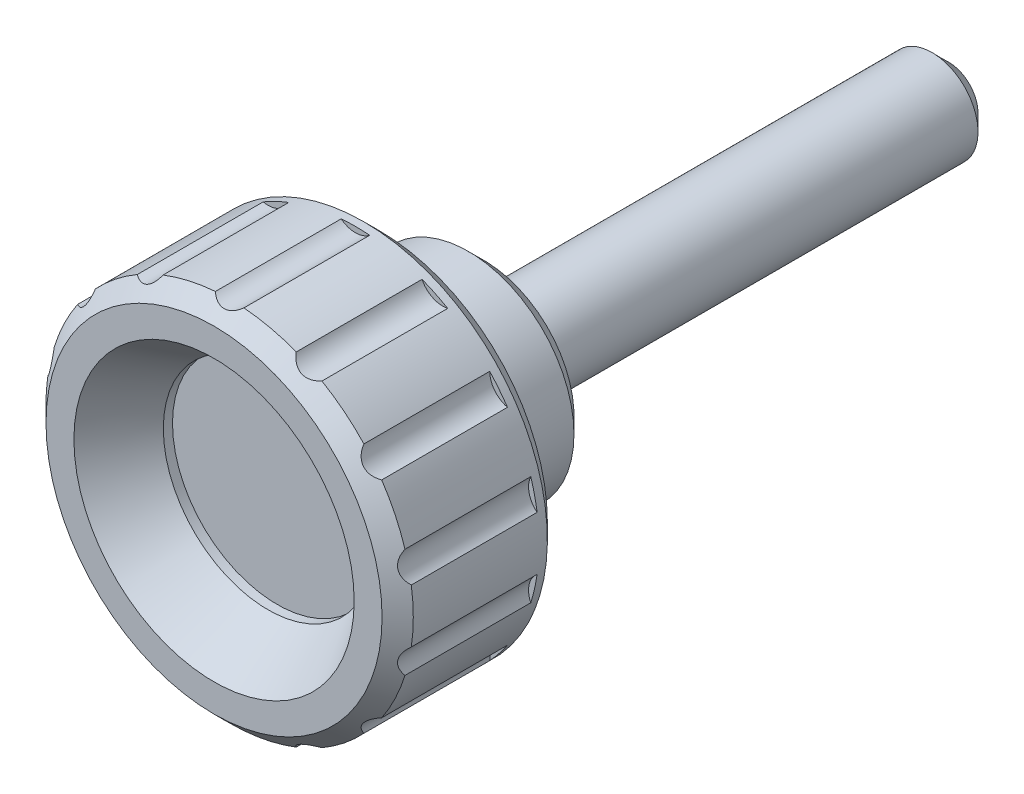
ISO-10303-21;
HEADER;
FILE_DESCRIPTION(('STEP AP214'),'2;1');
FILE_NAME('part.step','',(''),(''),'','','');
FILE_SCHEMA(('AUTOMOTIVE_DESIGN { 1 0 10303 214 1 1 1 1 }'));
ENDSEC;
DATA;
#1=APPLICATION_CONTEXT('core data for automotive mechanical design processes');
#2=APPLICATION_PROTOCOL_DEFINITION('international standard','automotive_design',2000,#1);
#3=PRODUCT_CONTEXT('',#1,'mechanical');
#4=PRODUCT('Part','Part','',(#3));
#5=PRODUCT_RELATED_PRODUCT_CATEGORY('part','',(#4));
#6=PRODUCT_DEFINITION_FORMATION('','',#4);
#7=PRODUCT_DEFINITION_CONTEXT('part definition',#1,'design');
#8=PRODUCT_DEFINITION('design','',#6,#7);
#9=PRODUCT_DEFINITION_SHAPE('','',#8);
#10=(LENGTH_UNIT() NAMED_UNIT(*) SI_UNIT(.MILLI.,.METRE.));
#11=(NAMED_UNIT(*) PLANE_ANGLE_UNIT() SI_UNIT($,.RADIAN.));
#12=(NAMED_UNIT(*) SI_UNIT($,.STERADIAN.) SOLID_ANGLE_UNIT());
#13=UNCERTAINTY_MEASURE_WITH_UNIT(LENGTH_MEASURE(1.E-05),#10,'distance_accuracy_value','');
#14=(GEOMETRIC_REPRESENTATION_CONTEXT(3) GLOBAL_UNCERTAINTY_ASSIGNED_CONTEXT((#13)) GLOBAL_UNIT_ASSIGNED_CONTEXT((#10,
#11,#12)) REPRESENTATION_CONTEXT('',''));
#15=CARTESIAN_POINT('',(0.,0.,0.));
#16=DIRECTION('',(0.,0.,1.));
#17=DIRECTION('',(1.,0.,0.));
#18=AXIS2_PLACEMENT_3D('',#15,#16,#17);
#19=CARTESIAN_POINT('',(3.99999999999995,0.,0.));
#20=DIRECTION('',(0.,0.,-1.));
#21=DIRECTION('',(0.,1.,0.));
#22=AXIS2_PLACEMENT_3D('',#19,#20,#21);
#23=PLANE('',#22);
#24=CARTESIAN_POINT('',(0.,0.,0.));
#25=DIRECTION('',(0.,0.,-1.));
#26=DIRECTION('',(-1.,0.,0.));
#27=AXIS2_PLACEMENT_3D('',#24,#25,#26);
#28=CIRCLE('',#27,3.5);
#29=CARTESIAN_POINT('',(-3.5,0.,0.));
#30=VERTEX_POINT('',#29);
#31=EDGE_CURVE('E276',#30,#30,#28,.F.);
#32=ORIENTED_EDGE('',*,*,#31,.F.);
#33=EDGE_LOOP('',(#32));
#34=FACE_BOUND('',#33,.T.);
#35=CARTESIAN_POINT('',(0.,0.,0.));
#36=DIRECTION('',(0.,0.,-1.));
#37=DIRECTION('',(-1.,0.,0.));
#38=AXIS2_PLACEMENT_3D('',#35,#36,#37);
#39=CIRCLE('',#38,2.5);
#40=CARTESIAN_POINT('',(-2.5,0.,0.));
#41=VERTEX_POINT('',#40);
#42=EDGE_CURVE('E1004',#41,#41,#39,.T.);
#43=ORIENTED_EDGE('',*,*,#42,.F.);
#44=EDGE_LOOP('',(#43));
#45=FACE_BOUND('',#44,.T.);
#46=ADVANCED_FACE('F14',(#34,#45),#23,.T.);
#47=CARTESIAN_POINT('',(0.,0.,0.));
#48=DIRECTION('',(0.,0.,-1.));
#49=DIRECTION('',(0.,1.,0.));
#50=AXIS2_PLACEMENT_3D('',#47,#48,#49);
#51=CYLINDRICAL_SURFACE('',#50,10.);
#52=CARTESIAN_POINT('',(0.,0.,14.15));
#53=DIRECTION('',(0.,0.,-1.));
#54=DIRECTION('',(-1.,0.,0.));
#55=AXIS2_PLACEMENT_3D('',#52,#53,#54);
#56=CIRCLE('',#55,10.);
#57=CARTESIAN_POINT('',(-8.27844244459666,-5.60958025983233,14.15));
#58=VERTEX_POINT('',#57);
#59=CARTESIAN_POINT('',(-9.54727089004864,-2.97483084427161,14.15));
#60=VERTEX_POINT('',#59);
#61=EDGE_CURVE('E227',#58,#60,#56,.T.);
#62=ORIENTED_EDGE('',*,*,#61,.T.);
#63=DIRECTION('',(0.,0.,1.));
#64=VECTOR('',#63,1.);
#65=CARTESIAN_POINT('',(-9.54727089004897,-2.97483084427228,7.3));
#66=LINE('',#65,#64);
#67=CARTESIAN_POINT('',(-9.54727089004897,-2.97483084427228,7.3));
#68=VERTEX_POINT('',#67);
#69=EDGE_CURVE('E235',#68,#60,#66,.T.);
#70=ORIENTED_EDGE('',*,*,#69,.F.);
#71=CARTESIAN_POINT('',(0.,0.,7.3));
#72=DIRECTION('',(0.,0.,1.));
#73=DIRECTION('',(0.,-1.,0.));
#74=AXIS2_PLACEMENT_3D('',#71,#72,#73);
#75=CIRCLE('',#74,10.);
#76=CARTESIAN_POINT('',(-9.89252457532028,-1.46217561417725,7.3));
#77=VERTEX_POINT('',#76);
#78=EDGE_CURVE('E440',#68,#77,#75,.F.);
#79=ORIENTED_EDGE('',*,*,#78,.T.);
#80=DIRECTION('',(0.,0.,1.));
#81=VECTOR('',#80,1.);
#82=CARTESIAN_POINT('',(-9.89252457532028,-1.46217561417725,7.3));
#83=LINE('',#82,#81);
#84=CARTESIAN_POINT('',(-9.89252457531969,-1.46217561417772,14.15));
#85=VERTEX_POINT('',#84);
#86=EDGE_CURVE('E226',#77,#85,#83,.T.);
#87=ORIENTED_EDGE('',*,*,#86,.T.);
#88=CARTESIAN_POINT('',(-9.8925245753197,1.46217561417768,14.15));
#89=VERTEX_POINT('',#88);
#90=EDGE_CURVE('E207',#85,#89,#56,.T.);
#91=ORIENTED_EDGE('',*,*,#90,.T.);
#92=DIRECTION('',(0.,0.,1.));
#93=VECTOR('',#92,1.);
#94=CARTESIAN_POINT('',(-9.89252457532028,1.46217561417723,7.3));
#95=LINE('',#94,#93);
#96=CARTESIAN_POINT('',(-9.89252457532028,1.46217561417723,7.3));
#97=VERTEX_POINT('',#96);
#98=EDGE_CURVE('E224',#97,#89,#95,.T.);
#99=ORIENTED_EDGE('',*,*,#98,.F.);
#100=CARTESIAN_POINT('',(-9.54727089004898,2.97483084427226,7.3));
#101=VERTEX_POINT('',#100);
#102=EDGE_CURVE('E962',#97,#101,#75,.F.);
#103=ORIENTED_EDGE('',*,*,#102,.T.);
#104=DIRECTION('',(0.,0.,1.));
#105=VECTOR('',#104,1.);
#106=CARTESIAN_POINT('',(-9.54727089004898,2.97483084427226,7.3));
#107=LINE('',#106,#105);
#108=CARTESIAN_POINT('',(-9.54727089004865,2.97483084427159,14.15));
#109=VERTEX_POINT('',#108);
#110=EDGE_CURVE('E233',#101,#109,#107,.T.);
#111=ORIENTED_EDGE('',*,*,#110,.T.);
#112=CARTESIAN_POINT('',(-8.27844244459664,5.60958025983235,14.15));
#113=VERTEX_POINT('',#112);
#114=EDGE_CURVE('E210',#109,#113,#56,.T.);
#115=ORIENTED_EDGE('',*,*,#114,.T.);
#116=DIRECTION('',(0.,0.,1.));
#117=VECTOR('',#116,1.);
#118=CARTESIAN_POINT('',(-8.27844244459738,5.60958025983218,7.3));
#119=LINE('',#118,#117);
#120=CARTESIAN_POINT('',(-8.27844244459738,5.60958025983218,7.3));
#121=VERTEX_POINT('',#120);
#122=EDGE_CURVE('E237',#121,#113,#119,.T.);
#123=ORIENTED_EDGE('',*,*,#122,.F.);
#124=CARTESIAN_POINT('',(-7.31106311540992,6.82263557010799,7.3));
#125=VERTEX_POINT('',#124);
#126=EDGE_CURVE('E963',#121,#125,#75,.F.);
#127=ORIENTED_EDGE('',*,*,#126,.T.);
#128=DIRECTION('',(0.,0.,1.));
#129=VECTOR('',#128,1.);
#130=CARTESIAN_POINT('',(-7.31106311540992,6.82263557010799,7.3));
#131=LINE('',#130,#129);
#132=CARTESIAN_POINT('',(-7.31106311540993,6.82263557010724,14.15));
#133=VERTEX_POINT('',#132);
#134=EDGE_CURVE('E243',#125,#133,#131,.T.);
#135=ORIENTED_EDGE('',*,*,#134,.T.);
#136=CARTESIAN_POINT('',(-5.02471325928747,8.64593873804,14.15));
#137=VERTEX_POINT('',#136);
#138=EDGE_CURVE('E972',#133,#137,#56,.T.);
#139=ORIENTED_EDGE('',*,*,#138,.T.);
#140=DIRECTION('',(0.,0.,1.));
#141=VECTOR('',#140,1.);
#142=CARTESIAN_POINT('',(-5.02471325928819,8.64593873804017,7.3));
#143=LINE('',#142,#141);
#144=CARTESIAN_POINT('',(-5.02471325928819,8.64593873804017,7.3));
#145=VERTEX_POINT('',#144);
#146=EDGE_CURVE('E246',#145,#137,#143,.T.);
#147=ORIENTED_EDGE('',*,*,#146,.F.);
#148=CARTESIAN_POINT('',(-3.62680962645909,9.3191336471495,7.3));
#149=VERTEX_POINT('',#148);
#150=EDGE_CURVE('E267',#145,#149,#75,.F.);
#151=ORIENTED_EDGE('',*,*,#150,.T.);
#152=DIRECTION('',(0.,0.,1.));
#153=VECTOR('',#152,1.);
#154=CARTESIAN_POINT('',(-3.62680962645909,9.3191336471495,7.3));
#155=LINE('',#154,#153);
#156=CARTESIAN_POINT('',(-3.62680962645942,9.31913364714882,14.15));
#157=VERTEX_POINT('',#156);
#158=EDGE_CURVE('E249',#149,#157,#155,.T.);
#159=ORIENTED_EDGE('',*,*,#158,.T.);
#160=CARTESIAN_POINT('',(-0.775777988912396,9.96986301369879,14.15));
#161=VERTEX_POINT('',#160);
#162=EDGE_CURVE('E974',#157,#161,#56,.T.);
#163=ORIENTED_EDGE('',*,*,#162,.T.);
#164=DIRECTION('',(0.,0.,1.));
#165=VECTOR('',#164,1.);
#166=CARTESIAN_POINT('',(-0.775777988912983,9.96986301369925,7.3));
#167=LINE('',#166,#165);
#168=CARTESIAN_POINT('',(-0.775777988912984,9.96986301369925,7.3));
#169=VERTEX_POINT('',#168);
#170=EDGE_CURVE('E252',#169,#161,#167,.T.);
#171=ORIENTED_EDGE('',*,*,#170,.F.);
#172=CARTESIAN_POINT('',(0.775777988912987,9.96986301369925,7.3));
#173=VERTEX_POINT('',#172);
#174=EDGE_CURVE('E41',#169,#173,#75,.F.);
#175=ORIENTED_EDGE('',*,*,#174,.T.);
#176=DIRECTION('',(0.,0.,1.));
#177=VECTOR('',#176,1.);
#178=CARTESIAN_POINT('',(0.775777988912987,9.96986301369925,7.3));
#179=LINE('',#178,#177);
#180=CARTESIAN_POINT('',(0.775777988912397,9.96986301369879,14.15));
#181=VERTEX_POINT('',#180);
#182=EDGE_CURVE('E255',#173,#181,#179,.T.);
#183=ORIENTED_EDGE('',*,*,#182,.T.);
#184=CARTESIAN_POINT('',(3.62680962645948,9.3191336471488,14.15));
#185=VERTEX_POINT('',#184);
#186=EDGE_CURVE('E975',#181,#185,#56,.T.);
#187=ORIENTED_EDGE('',*,*,#186,.T.);
#188=DIRECTION('',(0.,0.,1.));
#189=VECTOR('',#188,1.);
#190=CARTESIAN_POINT('',(3.62680962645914,9.31913364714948,7.3));
#191=LINE('',#190,#189);
#192=CARTESIAN_POINT('',(3.62680962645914,9.31913364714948,7.3));
#193=VERTEX_POINT('',#192);
#194=EDGE_CURVE('E263',#193,#185,#191,.T.);
#195=ORIENTED_EDGE('',*,*,#194,.F.);
#196=CARTESIAN_POINT('',(5.02471325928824,8.64593873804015,7.3));
#197=VERTEX_POINT('',#196);
#198=EDGE_CURVE('E268',#193,#197,#75,.F.);
#199=ORIENTED_EDGE('',*,*,#198,.T.);
#200=DIRECTION('',(0.,0.,1.));
#201=VECTOR('',#200,1.);
#202=CARTESIAN_POINT('',(5.02471325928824,8.64593873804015,7.3));
#203=LINE('',#202,#201);
#204=CARTESIAN_POINT('',(5.02471325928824,8.64593873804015,14.15));
#205=VERTEX_POINT('',#204);
#206=EDGE_CURVE('E385',#197,#205,#203,.T.);
#207=ORIENTED_EDGE('',*,*,#206,.T.);
#208=CARTESIAN_POINT('',(7.31106311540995,6.82263557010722,14.15));
#209=VERTEX_POINT('',#208);
#210=EDGE_CURVE('E34',#205,#209,#56,.T.);
#211=ORIENTED_EDGE('',*,*,#210,.T.);
#212=DIRECTION('',(0.,0.,1.));
#213=VECTOR('',#212,1.);
#214=CARTESIAN_POINT('',(7.31106311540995,6.82263557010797,7.3));
#215=LINE('',#214,#213);
#216=CARTESIAN_POINT('',(7.31106311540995,6.82263557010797,7.3));
#217=VERTEX_POINT('',#216);
#218=EDGE_CURVE('E388',#217,#209,#215,.T.);
#219=ORIENTED_EDGE('',*,*,#218,.F.);
#220=CARTESIAN_POINT('',(8.27844244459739,5.60958025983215,7.3));
#221=VERTEX_POINT('',#220);
#222=EDGE_CURVE('E940',#217,#221,#75,.F.);
#223=ORIENTED_EDGE('',*,*,#222,.T.);
#224=DIRECTION('',(0.,0.,1.));
#225=VECTOR('',#224,1.);
#226=CARTESIAN_POINT('',(8.27844244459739,5.60958025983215,7.3));
#227=LINE('',#226,#225);
#228=CARTESIAN_POINT('',(8.27844244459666,5.60958025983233,14.15));
#229=VERTEX_POINT('',#228);
#230=EDGE_CURVE('E391',#221,#229,#227,.T.);
#231=ORIENTED_EDGE('',*,*,#230,.T.);
#232=CARTESIAN_POINT('',(9.54727089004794,2.97483084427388,14.15));
#233=VERTEX_POINT('',#232);
#234=EDGE_CURVE('E977',#229,#233,#56,.T.);
#235=ORIENTED_EDGE('',*,*,#234,.T.);
#236=DIRECTION('',(0.,0.,1.));
#237=VECTOR('',#236,1.);
#238=CARTESIAN_POINT('',(9.54727089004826,2.97483084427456,7.3));
#239=LINE('',#238,#237);
#240=CARTESIAN_POINT('',(9.54727089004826,2.97483084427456,7.3));
#241=VERTEX_POINT('',#240);
#242=EDGE_CURVE('E394',#241,#233,#239,.T.);
#243=ORIENTED_EDGE('',*,*,#242,.F.);
#244=CARTESIAN_POINT('',(9.89252457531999,1.46217561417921,7.3));
#245=VERTEX_POINT('',#244);
#246=EDGE_CURVE('E942',#241,#245,#75,.F.);
#247=ORIENTED_EDGE('',*,*,#246,.T.);
#248=DIRECTION('',(0.,0.,1.));
#249=VECTOR('',#248,1.);
#250=CARTESIAN_POINT('',(9.89252457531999,1.46217561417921,7.3));
#251=LINE('',#250,#249);
#252=CARTESIAN_POINT('',(9.8925245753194,1.46217561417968,14.15));
#253=VERTEX_POINT('',#252);
#254=EDGE_CURVE('E397',#245,#253,#251,.T.);
#255=ORIENTED_EDGE('',*,*,#254,.T.);
#256=CARTESIAN_POINT('',(9.89252457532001,-1.46217561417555,14.15));
#257=VERTEX_POINT('',#256);
#258=EDGE_CURVE('E979',#253,#257,#56,.T.);
#259=ORIENTED_EDGE('',*,*,#258,.T.);
#260=DIRECTION('',(0.,0.,1.));
#261=VECTOR('',#260,1.);
#262=CARTESIAN_POINT('',(9.8925245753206,-1.46217561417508,7.3));
#263=LINE('',#262,#261);
#264=CARTESIAN_POINT('',(9.8925245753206,-1.46217561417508,7.3));
#265=VERTEX_POINT('',#264);
#266=EDGE_CURVE('E400',#265,#257,#263,.T.);
#267=ORIENTED_EDGE('',*,*,#266,.F.);
#268=CARTESIAN_POINT('',(9.54727089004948,-2.97483084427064,7.3));
#269=VERTEX_POINT('',#268);
#270=EDGE_CURVE('E944',#265,#269,#75,.F.);
#271=ORIENTED_EDGE('',*,*,#270,.T.);
#272=DIRECTION('',(0.,0.,1.));
#273=VECTOR('',#272,1.);
#274=CARTESIAN_POINT('',(9.54727089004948,-2.97483084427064,7.3));
#275=LINE('',#274,#273);
#276=CARTESIAN_POINT('',(9.54727089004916,-2.97483084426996,14.15));
#277=VERTEX_POINT('',#276);
#278=EDGE_CURVE('E403',#269,#277,#275,.T.);
#279=ORIENTED_EDGE('',*,*,#278,.T.);
#280=CARTESIAN_POINT('',(8.27844244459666,-5.60958025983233,14.15));
#281=VERTEX_POINT('',#280);
#282=EDGE_CURVE('E981',#277,#281,#56,.T.);
#283=ORIENTED_EDGE('',*,*,#282,.T.);
#284=DIRECTION('',(0.,0.,1.));
#285=VECTOR('',#284,1.);
#286=CARTESIAN_POINT('',(8.27844244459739,-5.60958025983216,7.3));
#287=LINE('',#286,#285);
#288=CARTESIAN_POINT('',(8.27844244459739,-5.60958025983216,7.3));
#289=VERTEX_POINT('',#288);
#290=EDGE_CURVE('E406',#289,#281,#287,.T.);
#291=ORIENTED_EDGE('',*,*,#290,.F.);
#292=CARTESIAN_POINT('',(7.31106311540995,-6.82263557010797,7.3));
#293=VERTEX_POINT('',#292);
#294=EDGE_CURVE('E947',#289,#293,#75,.F.);
#295=ORIENTED_EDGE('',*,*,#294,.T.);
#296=DIRECTION('',(0.,0.,1.));
#297=VECTOR('',#296,1.);
#298=CARTESIAN_POINT('',(7.31106311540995,-6.82263557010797,7.3));
#299=LINE('',#298,#297);
#300=CARTESIAN_POINT('',(7.31106311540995,-6.82263557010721,14.15));
#301=VERTEX_POINT('',#300);
#302=EDGE_CURVE('E409',#293,#301,#299,.T.);
#303=ORIENTED_EDGE('',*,*,#302,.T.);
#304=CARTESIAN_POINT('',(5.02471325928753,-8.64593873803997,14.15));
#305=VERTEX_POINT('',#304);
#306=EDGE_CURVE('E983',#301,#305,#56,.T.);
#307=ORIENTED_EDGE('',*,*,#306,.T.);
#308=DIRECTION('',(0.,0.,1.));
#309=VECTOR('',#308,1.);
#310=CARTESIAN_POINT('',(5.02471325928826,-8.64593873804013,7.3));
#311=LINE('',#310,#309);
#312=CARTESIAN_POINT('',(5.02471325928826,-8.64593873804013,7.3));
#313=VERTEX_POINT('',#312);
#314=EDGE_CURVE('E412',#313,#305,#311,.T.);
#315=ORIENTED_EDGE('',*,*,#314,.F.);
#316=CARTESIAN_POINT('',(3.62680962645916,-9.31913364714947,7.3));
#317=VERTEX_POINT('',#316);
#318=EDGE_CURVE('E950',#313,#317,#75,.F.);
#319=ORIENTED_EDGE('',*,*,#318,.T.);
#320=DIRECTION('',(0.,0.,1.));
#321=VECTOR('',#320,1.);
#322=CARTESIAN_POINT('',(3.62680962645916,-9.31913364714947,7.3));
#323=LINE('',#322,#321);
#324=CARTESIAN_POINT('',(3.62680962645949,-9.31913364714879,14.15));
#325=VERTEX_POINT('',#324);
#326=EDGE_CURVE('E415',#317,#325,#323,.T.);
#327=ORIENTED_EDGE('',*,*,#326,.T.);
#328=CARTESIAN_POINT('',(0.775777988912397,-9.96986301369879,14.15));
#329=VERTEX_POINT('',#328);
#330=EDGE_CURVE('E985',#325,#329,#56,.T.);
#331=ORIENTED_EDGE('',*,*,#330,.T.);
#332=DIRECTION('',(0.,0.,1.));
#333=VECTOR('',#332,1.);
#334=CARTESIAN_POINT('',(0.775777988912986,-9.96986301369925,7.3));
#335=LINE('',#334,#333);
#336=CARTESIAN_POINT('',(0.775777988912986,-9.96986301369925,7.3));
#337=VERTEX_POINT('',#336);
#338=EDGE_CURVE('E418',#337,#329,#335,.T.);
#339=ORIENTED_EDGE('',*,*,#338,.F.);
#340=CARTESIAN_POINT('',(-0.775777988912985,-9.96986301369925,7.3));
#341=VERTEX_POINT('',#340);
#342=EDGE_CURVE('E953',#337,#341,#75,.F.);
#343=ORIENTED_EDGE('',*,*,#342,.T.);
#344=DIRECTION('',(0.,0.,1.));
#345=VECTOR('',#344,1.);
#346=CARTESIAN_POINT('',(-0.775777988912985,-9.96986301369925,7.3));
#347=LINE('',#346,#345);
#348=CARTESIAN_POINT('',(-0.775777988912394,-9.96986301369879,14.15));
#349=VERTEX_POINT('',#348);
#350=EDGE_CURVE('E421',#341,#349,#347,.T.);
#351=ORIENTED_EDGE('',*,*,#350,.T.);
#352=CARTESIAN_POINT('',(-3.62680962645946,-9.3191336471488,14.15));
#353=VERTEX_POINT('',#352);
#354=EDGE_CURVE('E445',#349,#353,#56,.T.);
#355=ORIENTED_EDGE('',*,*,#354,.T.);
#356=DIRECTION('',(0.,0.,1.));
#357=VECTOR('',#356,1.);
#358=CARTESIAN_POINT('',(-3.62680962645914,-9.31913364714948,7.3));
#359=LINE('',#358,#357);
#360=CARTESIAN_POINT('',(-3.62680962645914,-9.31913364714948,7.3));
#361=VERTEX_POINT('',#360);
#362=EDGE_CURVE('E424',#361,#353,#359,.T.);
#363=ORIENTED_EDGE('',*,*,#362,.F.);
#364=CARTESIAN_POINT('',(-5.02471325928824,-8.64593873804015,7.3));
#365=VERTEX_POINT('',#364);
#366=EDGE_CURVE('E956',#361,#365,#75,.F.);
#367=ORIENTED_EDGE('',*,*,#366,.T.);
#368=DIRECTION('',(0.,0.,1.));
#369=VECTOR('',#368,1.);
#370=CARTESIAN_POINT('',(-5.02471325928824,-8.64593873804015,7.3));
#371=LINE('',#370,#369);
#372=CARTESIAN_POINT('',(-5.02471325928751,-8.64593873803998,14.15));
#373=VERTEX_POINT('',#372);
#374=EDGE_CURVE('E427',#365,#373,#371,.T.);
#375=ORIENTED_EDGE('',*,*,#374,.T.);
#376=CARTESIAN_POINT('',(-7.31106311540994,-6.82263557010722,14.15));
#377=VERTEX_POINT('',#376);
#378=EDGE_CURVE('E443',#373,#377,#56,.T.);
#379=ORIENTED_EDGE('',*,*,#378,.T.);
#380=DIRECTION('',(0.,0.,1.));
#381=VECTOR('',#380,1.);
#382=CARTESIAN_POINT('',(-7.31106311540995,-6.82263557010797,7.3));
#383=LINE('',#382,#381);
#384=CARTESIAN_POINT('',(-7.31106311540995,-6.82263557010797,7.3));
#385=VERTEX_POINT('',#384);
#386=EDGE_CURVE('E430',#385,#377,#383,.T.);
#387=ORIENTED_EDGE('',*,*,#386,.F.);
#388=CARTESIAN_POINT('',(-8.27844244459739,-5.60958025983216,7.3));
#389=VERTEX_POINT('',#388);
#390=EDGE_CURVE('E959',#385,#389,#75,.F.);
#391=ORIENTED_EDGE('',*,*,#390,.T.);
#392=DIRECTION('',(0.,0.,1.));
#393=VECTOR('',#392,1.);
#394=CARTESIAN_POINT('',(-8.27844244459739,-5.60958025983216,7.3));
#395=LINE('',#394,#393);
#396=EDGE_CURVE('E433',#389,#58,#395,.T.);
#397=ORIENTED_EDGE('',*,*,#396,.T.);
#398=EDGE_LOOP('',(#62,#70,#79,#87,#91,#99,#103,#111,#115,#123,#127,#135,#139,#147,#151,#159,
#163,#171,#175,#183,#187,#195,#199,#207,#211,#219,#223,#231,#235,#243,#247,#255,#259,#267,#271,
#279,#283,#291,#295,#303,#307,#315,#319,#327,#331,#339,#343,#351,#355,#363,#367,#375,#379,#387,
#391,#397));
#399=FACE_BOUND('',#398,.T.);
#400=CARTESIAN_POINT('',(0.,0.,6.85));
#401=DIRECTION('',(0.,0.,-1.));
#402=DIRECTION('',(0.,1.,0.));
#403=AXIS2_PLACEMENT_3D('',#400,#401,#402);
#404=CIRCLE('',#403,10.);
#405=CARTESIAN_POINT('',(0.,10.,6.85));
#406=VERTEX_POINT('',#405);
#407=EDGE_CURVE('E259',#406,#406,#404,.T.);
#408=ORIENTED_EDGE('',*,*,#407,.F.);
#409=EDGE_LOOP('',(#408));
#410=FACE_BOUND('',#409,.T.);
#411=ADVANCED_FACE('F221',(#399,#410),#51,.T.);
#412=CARTESIAN_POINT('',(9.15,0.,6.));
#413=DIRECTION('',(0.,0.,-1.));
#414=DIRECTION('',(0.,1.,0.));
#415=AXIS2_PLACEMENT_3D('',#412,#413,#414);
#416=PLANE('',#415);
#417=CARTESIAN_POINT('',(0.,0.,6.));
#418=DIRECTION('',(0.,0.,-1.));
#419=DIRECTION('',(0.,1.,0.));
#420=AXIS2_PLACEMENT_3D('',#417,#418,#419);
#421=CIRCLE('',#420,9.15);
#422=CARTESIAN_POINT('',(0.,9.15,6.));
#423=VERTEX_POINT('',#422);
#424=EDGE_CURVE('E262',#423,#423,#421,.T.);
#425=ORIENTED_EDGE('',*,*,#424,.T.);
#426=EDGE_LOOP('',(#425));
#427=FACE_BOUND('',#426,.T.);
#428=CARTESIAN_POINT('',(0.,0.,6.));
#429=DIRECTION('',(0.,0.,-1.));
#430=DIRECTION('',(-1.,0.,0.));
#431=AXIS2_PLACEMENT_3D('',#428,#429,#430);
#432=CIRCLE('',#431,5.75);
#433=CARTESIAN_POINT('',(-5.75,0.,6.));
#434=VERTEX_POINT('',#433);
#435=EDGE_CURVE('E279',#434,#434,#432,.T.);
#436=ORIENTED_EDGE('',*,*,#435,.F.);
#437=EDGE_LOOP('',(#436));
#438=FACE_BOUND('',#437,.T.);
#439=ADVANCED_FACE('F311',(#427,#438),#416,.T.);
#440=CARTESIAN_POINT('',(0.,0.,6.));
#441=DIRECTION('',(0.,0.,1.));
#442=DIRECTION('',(0.,-1.,0.));
#443=AXIS2_PLACEMENT_3D('',#440,#441,#442);
#444=CONICAL_SURFACE('',#443,9.15,0.785398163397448);
#445=ORIENTED_EDGE('',*,*,#407,.T.);
#446=EDGE_LOOP('',(#445));
#447=FACE_BOUND('',#446,.T.);
#448=ORIENTED_EDGE('',*,*,#424,.F.);
#449=EDGE_LOOP('',(#448));
#450=FACE_BOUND('',#449,.T.);
#451=ADVANCED_FACE('F577',(#447,#450),#444,.T.);
#452=CARTESIAN_POINT('',(0.,10.9500000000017,7.3));
#453=DIRECTION('',(0.,0.,1.));
#454=DIRECTION('',(0.,-1.,0.));
#455=AXIS2_PLACEMENT_3D('',#452,#453,#454);
#456=CYLINDRICAL_SURFACE('',#455,1.25);
#457=CARTESIAN_POINT('',(0.775977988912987,9.97002134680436,14.1498266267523));
#458=CARTESIAN_POINT('',(0.734586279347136,9.93724261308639,14.1857107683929));
#459=CARTESIAN_POINT('',(0.68995529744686,9.90618033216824,14.2199249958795));
#460=CARTESIAN_POINT('',(0.593942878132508,9.84868428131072,14.2835331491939));
#461=CARTESIAN_POINT('',(0.542499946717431,9.82229852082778,14.3128768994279));
#462=CARTESIAN_POINT('',(0.443151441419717,9.78017982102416,14.3598826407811));
#463=CARTESIAN_POINT('',(0.396256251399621,9.76338583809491,14.3786950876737));
#464=CARTESIAN_POINT('',(0.299067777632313,9.73525526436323,14.4102700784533));
#465=CARTESIAN_POINT('',(0.248787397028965,9.7238991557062,14.4230542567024));
#466=CARTESIAN_POINT('',(0.145474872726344,9.70738511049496,14.4416620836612));
#467=CARTESIAN_POINT('',(0.0924231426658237,9.70228010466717,14.4474262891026));
#468=CARTESIAN_POINT('',(-0.0142000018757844,9.69894396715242,14.4511919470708));
#469=CARTESIAN_POINT('',(-0.0677715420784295,9.70071454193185,14.4491914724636));
#470=CARTESIAN_POINT('',(-0.167200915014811,9.71034496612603,14.4383278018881));
#471=CARTESIAN_POINT('',(-0.213227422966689,9.71746747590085,14.4302956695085));
#472=CARTESIAN_POINT('',(-0.30302476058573,9.7364164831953,14.4089716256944));
#473=CARTESIAN_POINT('',(-0.346794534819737,9.74824515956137,14.3956772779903));
#474=CARTESIAN_POINT('',(-0.445997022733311,9.78073865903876,14.3592589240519));
#475=CARTESIAN_POINT('',(-0.500224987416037,9.80304471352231,14.3343253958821));
#476=CARTESIAN_POINT('',(-0.602533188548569,9.8533143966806,14.2784064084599));
#477=CARTESIAN_POINT('',(-0.650605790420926,9.88128494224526,14.2474135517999));
#478=CARTESIAN_POINT('',(-0.723578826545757,9.93016500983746,14.1935419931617));
#479=CARTESIAN_POINT('',(-0.750378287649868,9.94975642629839,14.1720143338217));
#480=CARTESIAN_POINT('',(-0.775977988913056,9.97002134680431,14.1498266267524));
#481=B_SPLINE_CURVE_WITH_KNOTS('',3,(#457,#458,#459,#460,#461,#462,#463,#464,#465,#466,#467,
#468,#469,#470,#471,#472,#473,#474,#475,#476,#477,#478,#479,#480),.UNSPECIFIED.,.F.,.F.,(4,2,2,
2,2,2,2,2,2,2,2,4),(0.,0.191836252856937,0.385540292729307,0.544632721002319,0.703149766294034,
0.86299996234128,1.022889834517,1.16405643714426,1.3052884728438,1.49538818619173,
1.68572144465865,1.80423553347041),.UNSPECIFIED.);
#482=EDGE_CURVE('E559',#181,#161,#481,.T.);
#483=ORIENTED_EDGE('',*,*,#482,.F.);
#484=ORIENTED_EDGE('',*,*,#182,.F.);
#485=CARTESIAN_POINT('',(0.,10.9500000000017,7.3));
#486=DIRECTION('',(0.,0.,-1.));
#487=DIRECTION('',(0.,-1.,0.));
#488=AXIS2_PLACEMENT_3D('',#485,#486,#487);
#489=CIRCLE('',#488,1.25);
#490=EDGE_CURVE('E341',#173,#169,#489,.T.);
#491=ORIENTED_EDGE('',*,*,#490,.T.);
#492=ORIENTED_EDGE('',*,*,#170,.T.);
#493=EDGE_LOOP('',(#483,#484,#491,#492));
#494=FACE_BOUND('',#493,.T.);
#495=ADVANCED_FACE('F573',(#494),#456,.F.);
#496=CARTESIAN_POINT('',(0.,0.,7.3));
#497=DIRECTION('',(0.,0.,1.));
#498=DIRECTION('',(0.,-1.,0.));
#499=AXIS2_PLACEMENT_3D('',#496,#497,#498);
#500=PLANE('',#499);
#501=ORIENTED_EDGE('',*,*,#490,.F.);
#502=ORIENTED_EDGE('',*,*,#174,.F.);
#503=EDGE_LOOP('',(#501,#502));
#504=FACE_BOUND('',#503,.T.);
#505=ADVANCED_FACE('F569',(#504),#500,.T.);
#506=CARTESIAN_POINT('',(-4.75102694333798,9.86560910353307,7.3));
#507=DIRECTION('',(0.,0.,1.));
#508=DIRECTION('',(0.,-1.,0.));
#509=AXIS2_PLACEMENT_3D('',#506,#507,#508);
#510=CYLINDRICAL_SURFACE('',#509,1.25);
#511=CARTESIAN_POINT('',(-3.62668101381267,9.31939831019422,14.1498));
#512=CARTESIAN_POINT('',(-3.64975063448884,9.27190450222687,14.185686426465));
#513=CARTESIAN_POINT('',(-3.67648365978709,9.22455160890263,14.2199029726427));
#514=CARTESIAN_POINT('',(-3.73804039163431,9.13108688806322,14.2835157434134));
#515=CARTESIAN_POINT('',(-3.77294034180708,9.08499163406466,14.3128617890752));
#516=CARTESIAN_POINT('',(-3.84417515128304,9.00393496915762,14.3598710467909));
#517=CARTESIAN_POINT('',(-3.87913908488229,8.96845594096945,14.3786848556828));
#518=CARTESIAN_POINT('',(-3.95449665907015,8.90094031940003,14.4102625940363));
#519=CARTESIAN_POINT('',(-3.99487020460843,8.86889173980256,14.4230481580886));
#520=CARTESIAN_POINT('',(-4.08078621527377,8.80918487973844,14.4416586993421));
#521=CARTESIAN_POINT('',(-4.12636930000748,8.78156579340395,14.447424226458));
#522=CARTESIAN_POINT('',(-4.2209865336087,8.73229533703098,14.4511922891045));
#523=CARTESIAN_POINT('',(-4.27002153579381,8.71064544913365,14.4491928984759));
#524=CARTESIAN_POINT('',(-4.36378339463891,8.67617932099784,14.4383310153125));
#525=CARTESIAN_POINT('',(-4.4083422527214,8.66262548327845,14.4302997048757));
#526=CARTESIAN_POINT('',(-4.49746880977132,8.64073471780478,14.408977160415));
#527=CARTESIAN_POINT('',(-4.54203650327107,8.63240020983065,14.3956834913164));
#528=CARTESIAN_POINT('',(-4.64551253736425,8.61863194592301,14.35926702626));
#529=CARTESIAN_POINT('',(-4.70404762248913,8.61519944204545,14.3343348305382));
#530=CARTESIAN_POINT('',(-4.81803389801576,8.6160989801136,14.2784184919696));
#531=CARTESIAN_POINT('',(-4.87348120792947,8.62044057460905,14.2474269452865));
#532=CARTESIAN_POINT('',(-4.96045702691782,8.63281949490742,14.1935439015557));
#533=CARTESIAN_POINT('',(-4.99312357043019,8.63884697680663,14.1720023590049));
#534=CARTESIAN_POINT('',(-5.02500036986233,8.6460031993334,14.1498));
#535=B_SPLINE_CURVE_WITH_KNOTS('',3,(#511,#512,#513,#514,#515,#516,#517,#518,#519,#520,#521,
#522,#523,#524,#525,#526,#527,#528,#529,#530,#531,#532,#533,#534),.UNSPECIFIED.,.F.,.F.,(4,2,2,
2,2,2,2,2,2,2,2,4),(0.,0.191843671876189,0.385555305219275,0.544650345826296,0.70316998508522,
0.863022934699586,1.02291553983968,1.16408261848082,1.305315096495,1.49541104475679,
1.68574073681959,1.80433015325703),.UNSPECIFIED.);
#536=EDGE_CURVE('E553',#157,#137,#535,.T.);
#537=ORIENTED_EDGE('',*,*,#536,.F.);
#538=ORIENTED_EDGE('',*,*,#158,.F.);
#539=CARTESIAN_POINT('',(-4.75102694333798,9.86560910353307,7.3));
#540=DIRECTION('',(0.,0.,-1.));
#541=DIRECTION('',(0.,-1.,0.));
#542=AXIS2_PLACEMENT_3D('',#539,#540,#541);
#543=CIRCLE('',#542,1.25);
#544=EDGE_CURVE('E343',#149,#145,#543,.T.);
#545=ORIENTED_EDGE('',*,*,#544,.T.);
#546=ORIENTED_EDGE('',*,*,#146,.T.);
#547=EDGE_LOOP('',(#537,#538,#545,#546));
#548=FACE_BOUND('',#547,.T.);
#549=ADVANCED_FACE('F565',(#548),#510,.F.);
#550=ORIENTED_EDGE('',*,*,#544,.F.);
#551=ORIENTED_EDGE('',*,*,#150,.F.);
#552=EDGE_LOOP('',(#550,#551));
#553=FACE_BOUND('',#552,.T.);
#554=ADVANCED_FACE('F568',(#553),#500,.T.);
#555=CARTESIAN_POINT('',(-8.56105473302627,6.82721333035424,7.3));
#556=DIRECTION('',(0.,0.,1.));
#557=DIRECTION('',(0.,-1.,0.));
#558=AXIS2_PLACEMENT_3D('',#555,#556,#557);
#559=CYLINDRICAL_SURFACE('',#558,1.25);
#560=CARTESIAN_POINT('',(-7.31106207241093,6.82292982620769,14.1498));
#561=CARTESIAN_POINT('',(-7.31124029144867,6.77012985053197,14.185686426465));
#562=CARTESIAN_POINT('',(-7.31478026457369,6.7158673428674,14.2199029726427));
#563=CARTESIAN_POINT('',(-7.32968814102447,6.60495007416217,14.2835157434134));
#564=CARTESIAN_POINT('',(-7.34113192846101,6.54827716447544,14.3128617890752));
#565=CARTESIAN_POINT('',(-7.37014310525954,6.44434000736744,14.3598710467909));
#566=CARTESIAN_POINT('',(-7.38625074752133,6.39720422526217,14.3786848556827));
#567=CARTESIAN_POINT('',(-7.42485164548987,6.30367832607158,14.4102625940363));
#568=CARTESIAN_POINT('',(-7.44732159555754,6.25728612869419,14.4230481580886));
#569=CARTESIAN_POINT('',(-7.4988234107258,6.16621454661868,14.4416586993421));
#570=CARTESIAN_POINT('',(-7.52790887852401,6.1215528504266,14.447424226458));
#571=CARTESIAN_POINT('',(-7.59177841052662,6.03610882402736,14.4511922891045));
#572=CARTESIAN_POINT('',(-7.62656388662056,5.99532745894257,14.449192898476));
#573=CARTESIAN_POINT('',(-7.69608610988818,5.92359280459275,14.4383310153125));
#574=CARTESIAN_POINT('',(-7.73035146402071,5.89204785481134,14.4302997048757));
#575=CARTESIAN_POINT('',(-7.80115367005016,5.83365439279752,14.408977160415));
#576=CARTESIAN_POINT('',(-7.83769156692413,5.80680806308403,14.3956834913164));
#577=CARTESIAN_POINT('',(-7.92494642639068,5.74950671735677,14.35926702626));
#578=CARTESIAN_POINT('',(-7.97619540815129,5.72101671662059,14.3343348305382));
#579=CARTESIAN_POINT('',(-8.07928378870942,5.67237038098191,14.2784184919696));
#580=CARTESIAN_POINT('',(-8.13112383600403,5.65222433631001,14.2474269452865));
#581=CARTESIAN_POINT('',(-8.21485735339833,5.62563996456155,14.1935439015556));
#582=CARTESIAN_POINT('',(-8.24690411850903,5.61689705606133,14.1720023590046));
#583=CARTESIAN_POINT('',(-8.27872909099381,5.60951376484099,14.1497999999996));
#584=B_SPLINE_CURVE_WITH_KNOTS('',3,(#560,#561,#562,#563,#564,#565,#566,#567,#568,#569,#570,
#571,#572,#573,#574,#575,#576,#577,#578,#579,#580,#581,#582,#583),.UNSPECIFIED.,.F.,.F.,(4,2,2,
2,2,2,2,2,2,2,2,4),(0.,0.191843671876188,0.385555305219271,0.544650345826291,0.703169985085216,
0.863022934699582,1.02291553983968,1.16408261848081,1.30531509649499,1.49541104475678,
1.68574073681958,1.80433015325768),.UNSPECIFIED.);
#585=EDGE_CURVE('E214',#133,#113,#584,.T.);
#586=ORIENTED_EDGE('',*,*,#585,.F.);
#587=ORIENTED_EDGE('',*,*,#134,.F.);
#588=CARTESIAN_POINT('',(-8.56105473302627,6.82721333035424,7.3));
#589=DIRECTION('',(0.,0.,-1.));
#590=DIRECTION('',(0.,-1.,0.));
#591=AXIS2_PLACEMENT_3D('',#588,#589,#590);
#592=CIRCLE('',#591,1.25);
#593=EDGE_CURVE('E350',#125,#121,#592,.T.);
#594=ORIENTED_EDGE('',*,*,#593,.T.);
#595=ORIENTED_EDGE('',*,*,#122,.T.);
#596=EDGE_LOOP('',(#586,#587,#594,#595));
#597=FACE_BOUND('',#596,.T.);
#598=ADVANCED_FACE('F571',(#597),#559,.F.);
#599=ORIENTED_EDGE('',*,*,#593,.F.);
#600=ORIENTED_EDGE('',*,*,#126,.F.);
#601=EDGE_LOOP('',(#599,#600));
#602=FACE_BOUND('',#601,.T.);
#603=ADVANCED_FACE('F635',(#602),#500,.T.);
#604=CARTESIAN_POINT('',(-10.6754606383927,2.43660422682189,7.3));
#605=DIRECTION('',(0.,0.,1.));
#606=DIRECTION('',(0.,-1.,0.));
#607=AXIS2_PLACEMENT_3D('',#604,#605,#606);
#608=CYLINDRICAL_SURFACE('',#607,1.25);
#609=CARTESIAN_POINT('',(-9.54736632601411,2.97503084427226,14.1498493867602));
#610=CARTESIAN_POINT('',(-9.52462174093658,2.9273834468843,14.1857315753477));
#611=CARTESIAN_POINT('',(-9.50427134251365,2.87696010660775,14.2199438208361));
#612=CARTESIAN_POINT('',(-9.46958497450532,2.77056257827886,14.2835480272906));
#613=CARTESIAN_POINT('',(-9.45530948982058,2.71453912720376,14.3128898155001));
#614=CARTESIAN_POINT('',(-9.43635639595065,2.60831065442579,14.3598925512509));
#615=CARTESIAN_POINT('',(-9.43041966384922,2.55885444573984,14.3787038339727));
#616=CARTESIAN_POINT('',(-9.42462285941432,2.45784375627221,14.4102764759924));
#617=CARTESIAN_POINT('',(-9.42474088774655,2.40629751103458,14.4230594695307));
#618=CARTESIAN_POINT('',(-9.43163191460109,2.30190179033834,14.4416649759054));
#619=CARTESIAN_POINT('',(-9.43846086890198,2.24904500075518,14.4474280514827));
#620=CARTESIAN_POINT('',(-9.45893571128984,2.14435457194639,14.4511916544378));
#621=CARTESIAN_POINT('',(-9.47258329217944,2.09252119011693,14.4491902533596));
#622=CARTESIAN_POINT('',(-9.50409843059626,1.99772918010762,14.4383250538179));
#623=CARTESIAN_POINT('',(-9.52128475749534,1.95444204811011,14.4302922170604));
#624=CARTESIAN_POINT('',(-9.55974139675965,1.8711137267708,14.4089668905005));
#625=CARTESIAN_POINT('',(-9.58101359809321,1.83107405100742,14.3956719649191));
#626=CARTESIAN_POINT('',(-9.63476844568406,1.7415896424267,14.3592520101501));
#627=CARTESIAN_POINT('',(-9.66858315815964,1.69368480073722,14.3343173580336));
#628=CARTESIAN_POINT('',(-9.74036028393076,1.60512785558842,14.2783961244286));
#629=CARTESIAN_POINT('',(-9.77832774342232,1.56448473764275,14.2474021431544));
#630=CARTESIAN_POINT('',(-9.84222639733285,1.50421436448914,14.1935250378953));
#631=CARTESIAN_POINT('',(-9.86729531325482,1.48244282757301,14.1719926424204));
#632=CARTESIAN_POINT('',(-9.89275398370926,1.46199133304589,14.1497999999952));
#633=B_SPLINE_CURVE_WITH_KNOTS('',3,(#609,#610,#611,#612,#613,#614,#615,#616,#617,#618,#619,
#620,#621,#622,#623,#624,#625,#626,#627,#628,#629,#630,#631,#632),.UNSPECIFIED.,.F.,.F.,(4,2,2,
2,2,2,2,2,2,2,2,4),(0.,0.191829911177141,0.385527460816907,0.54461765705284,0.703132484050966,
0.862980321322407,1.02286786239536,1.16403407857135,1.30526571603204,1.49536852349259,
1.68570495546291,1.80424243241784),.UNSPECIFIED.);
#634=EDGE_CURVE('E203',#109,#89,#633,.T.);
#635=ORIENTED_EDGE('',*,*,#634,.F.);
#636=ORIENTED_EDGE('',*,*,#110,.F.);
#637=CARTESIAN_POINT('',(-10.6754606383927,2.43660422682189,7.3));
#638=DIRECTION('',(0.,0.,-1.));
#639=DIRECTION('',(0.,-1.,0.));
#640=AXIS2_PLACEMENT_3D('',#637,#638,#639);
#641=CIRCLE('',#640,1.25);
#642=EDGE_CURVE('E232',#101,#97,#641,.T.);
#643=ORIENTED_EDGE('',*,*,#642,.T.);
#644=ORIENTED_EDGE('',*,*,#98,.T.);
#645=EDGE_LOOP('',(#635,#636,#643,#644));
#646=FACE_BOUND('',#645,.T.);
#647=ADVANCED_FACE('F230',(#646),#608,.F.);
#648=ORIENTED_EDGE('',*,*,#642,.F.);
#649=ORIENTED_EDGE('',*,*,#102,.F.);
#650=EDGE_LOOP('',(#648,#649));
#651=FACE_BOUND('',#650,.T.);
#652=ADVANCED_FACE('F650',(#651),#500,.T.);
#653=CARTESIAN_POINT('',(-10.6754606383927,-2.43660422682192,7.3));
#654=DIRECTION('',(0.,0.,1.));
#655=DIRECTION('',(0.,-1.,0.));
#656=AXIS2_PLACEMENT_3D('',#653,#654,#655);
#657=CYLINDRICAL_SURFACE('',#656,1.25);
#658=CARTESIAN_POINT('',(-9.89275398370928,-1.46199133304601,14.1497999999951));
#659=CARTESIAN_POINT('',(-9.85158441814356,-1.49505091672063,14.185686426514));
#660=CARTESIAN_POINT('',(-9.81136741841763,-1.53165069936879,14.2199029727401));
#661=CARTESIAN_POINT('',(-9.73394371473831,-1.61246193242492,14.283515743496));
#662=CARTESIAN_POINT('',(-9.69677013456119,-1.65674402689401,14.3128617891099));
#663=CARTESIAN_POINT('',(-9.63359696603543,-1.74422963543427,14.3598710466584));
#664=CARTESIAN_POINT('',(-9.60678767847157,-1.78621177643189,14.3786848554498));
#665=CARTESIAN_POINT('',(-9.55773345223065,-1.87470361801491,14.4102625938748));
#666=CARTESIAN_POINT('',(-9.53547235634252,-1.92119639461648,14.4230481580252));
#667=CARTESIAN_POINT('',(-9.49638058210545,-2.01824433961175,14.4416586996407));
#668=CARTESIAN_POINT('',(-9.47959715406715,-2.06883038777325,14.4474242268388));
#669=CARTESIAN_POINT('',(-9.45261632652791,-2.17203907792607,14.4511922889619));
#670=CARTESIAN_POINT('',(-9.44242056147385,-2.22466222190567,14.4491928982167));
#671=CARTESIAN_POINT('',(-9.42968254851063,-2.32374270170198,14.438331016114));
#672=CARTESIAN_POINT('',(-9.42638381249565,-2.37020038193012,14.4302997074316));
#673=CARTESIAN_POINT('',(-9.42487441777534,-2.46196350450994,14.4089771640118));
#674=CARTESIAN_POINT('',(-9.42666611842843,-2.50726840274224,14.3956834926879));
#675=CARTESIAN_POINT('',(-9.43626864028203,-2.61121384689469,14.3592670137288));
#676=CARTESIAN_POINT('',(-9.44594748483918,-2.66904517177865,14.3343348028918));
#677=CARTESIAN_POINT('',(-9.47218881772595,-2.77997341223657,14.2784184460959));
#678=CARTESIAN_POINT('',(-9.48875974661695,-2.83306442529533,14.2474269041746));
#679=CARTESIAN_POINT('',(-9.52017328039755,-2.9150816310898,14.1935592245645));
#680=CARTESIAN_POINT('',(-9.53330808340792,-2.94556603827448,14.1720342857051));
#681=CARTESIAN_POINT('',(-9.54736632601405,-2.97503084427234,14.1498493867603));
#682=B_SPLINE_CURVE_WITH_KNOTS('',3,(#658,#659,#660,#661,#662,#663,#664,#665,#666,#667,#668,
#669,#670,#671,#672,#673,#674,#675,#676,#677,#678,#679,#680,#681),.UNSPECIFIED.,.F.,.F.,(4,2,2,
2,2,2,2,2,2,2,2,4),(0.,0.191843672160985,0.385555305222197,0.544650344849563,0.703169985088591,
0.863022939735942,1.02291553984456,1.16408259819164,1.30531509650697,1.49541116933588,
1.68574073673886,1.80424237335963),.UNSPECIFIED.);
#683=EDGE_CURVE('E215',#85,#60,#682,.T.);
#684=ORIENTED_EDGE('',*,*,#683,.F.);
#685=ORIENTED_EDGE('',*,*,#86,.F.);
#686=CARTESIAN_POINT('',(-10.6754606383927,-2.43660422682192,7.3));
#687=DIRECTION('',(0.,0.,-1.));
#688=DIRECTION('',(0.,-1.,0.));
#689=AXIS2_PLACEMENT_3D('',#686,#687,#688);
#690=CIRCLE('',#689,1.25);
#691=EDGE_CURVE('E354',#77,#68,#690,.T.);
#692=ORIENTED_EDGE('',*,*,#691,.T.);
#693=ORIENTED_EDGE('',*,*,#69,.T.);
#694=EDGE_LOOP('',(#684,#685,#692,#693));
#695=FACE_BOUND('',#694,.T.);
#696=ADVANCED_FACE('F438',(#695),#657,.F.);
#697=ORIENTED_EDGE('',*,*,#691,.F.);
#698=ORIENTED_EDGE('',*,*,#78,.F.);
#699=EDGE_LOOP('',(#697,#698));
#700=FACE_BOUND('',#699,.T.);
#701=ADVANCED_FACE('F664',(#700),#500,.T.);
#702=CARTESIAN_POINT('',(-8.56105473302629,-6.82721333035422,7.3));
#703=DIRECTION('',(0.,0.,1.));
#704=DIRECTION('',(0.,-1.,0.));
#705=AXIS2_PLACEMENT_3D('',#702,#703,#704);
#706=CYLINDRICAL_SURFACE('',#705,1.25);
#707=CARTESIAN_POINT('',(-8.27872909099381,-5.60951376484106,14.1497999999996));
#708=CARTESIAN_POINT('',(-8.22729257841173,-5.62143661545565,14.1856864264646));
#709=CARTESIAN_POINT('',(-8.17517826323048,-5.63696237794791,14.2199029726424));
#710=CARTESIAN_POINT('',(-8.07035923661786,-5.67617789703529,14.2835157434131));
#711=CARTESIAN_POINT('',(-8.01765371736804,-5.69994567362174,14.3128617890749));
#712=CARTESIAN_POINT('',(-7.92277807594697,-5.75135767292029,14.3598710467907));
#713=CARTESIAN_POINT('',(-7.88040837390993,-5.77755016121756,14.3786848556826));
#714=CARTESIAN_POINT('',(-7.79781687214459,-5.83599472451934,14.4102625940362));
#715=CARTESIAN_POINT('',(-7.75758785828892,-5.86822454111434,14.4230481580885));
#716=CARTESIAN_POINT('',(-7.68025986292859,-5.93870043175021,14.4416586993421));
#717=CARTESIAN_POINT('',(-7.64319005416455,-5.97699482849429,14.447424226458));
#718=CARTESIAN_POINT('',(-7.57410059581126,-6.05827610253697,14.4511922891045));
#719=CARTESIAN_POINT('',(-7.54208220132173,-6.10126414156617,14.449192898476));
#720=CARTESIAN_POINT('',(-7.48761623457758,-6.18500575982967,14.4383310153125));
#721=CARTESIAN_POINT('',(-7.46448694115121,-6.22543142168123,14.4302997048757));
#722=CARTESIAN_POINT('',(-7.42331249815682,-6.30745223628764,14.408977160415));
#723=CARTESIAN_POINT('',(-7.40526970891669,-6.34904792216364,14.3956834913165));
#724=CARTESIAN_POINT('',(-7.3688210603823,-6.44686586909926,14.3592670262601));
#725=CARTESIAN_POINT('',(-7.35244933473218,-6.50316955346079,14.3343348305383));
#726=CARTESIAN_POINT('',(-7.32796198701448,-6.61449812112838,14.2784184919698));
#727=CARTESIAN_POINT('',(-7.3198565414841,-6.66952134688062,14.2474269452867));
#728=CARTESIAN_POINT('',(-7.31257115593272,-6.7570710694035,14.1935439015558));
#729=CARTESIAN_POINT('',(-7.31117852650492,-6.79025983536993,14.172002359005));
#730=CARTESIAN_POINT('',(-7.31106207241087,-6.8229298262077,14.1498));
#731=B_SPLINE_CURVE_WITH_KNOTS('',3,(#707,#708,#709,#710,#711,#712,#713,#714,#715,#716,#717,
#718,#719,#720,#721,#722,#723,#724,#725,#726,#727,#728,#729,#730),.UNSPECIFIED.,.F.,.F.,(4,2,2,
2,2,2,2,2,2,2,2,4),(0.,0.191843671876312,0.38555530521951,0.544650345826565,0.703169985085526,
0.863022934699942,1.02291553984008,1.16408261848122,1.30531509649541,1.49541104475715,
1.68574073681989,1.8043301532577),.UNSPECIFIED.);
#732=EDGE_CURVE('E527',#58,#377,#731,.T.);
#733=ORIENTED_EDGE('',*,*,#732,.F.);
#734=ORIENTED_EDGE('',*,*,#396,.F.);
#735=CARTESIAN_POINT('',(-8.56105473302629,-6.82721333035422,7.3));
#736=DIRECTION('',(0.,0.,-1.));
#737=DIRECTION('',(0.,-1.,0.));
#738=AXIS2_PLACEMENT_3D('',#735,#736,#737);
#739=CIRCLE('',#738,1.25);
#740=EDGE_CURVE('E357',#389,#385,#739,.T.);
#741=ORIENTED_EDGE('',*,*,#740,.T.);
#742=ORIENTED_EDGE('',*,*,#386,.T.);
#743=EDGE_LOOP('',(#733,#734,#741,#742));
#744=FACE_BOUND('',#743,.T.);
#745=ADVANCED_FACE('F677',(#744),#706,.F.);
#746=ORIENTED_EDGE('',*,*,#740,.F.);
#747=ORIENTED_EDGE('',*,*,#390,.F.);
#748=EDGE_LOOP('',(#746,#747));
#749=FACE_BOUND('',#748,.T.);
#750=ADVANCED_FACE('F679',(#749),#500,.T.);
#751=CARTESIAN_POINT('',(-4.75102694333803,-9.86560910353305,7.3));
#752=DIRECTION('',(0.,0.,1.));
#753=DIRECTION('',(0.,-1.,0.));
#754=AXIS2_PLACEMENT_3D('',#751,#752,#753);
#755=CYLINDRICAL_SURFACE('',#754,1.25);
#756=CARTESIAN_POINT('',(-5.02500036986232,-8.64600319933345,14.1498));
#757=CARTESIAN_POINT('',(-4.97348454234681,-8.63442785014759,14.185686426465));
#758=CARTESIAN_POINT('',(-4.91979479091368,-8.6258045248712,14.2199029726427));
#759=CARTESIAN_POINT('',(-4.80834113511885,-8.61565721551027,14.2835157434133));
#760=CARTESIAN_POINT('',(-4.75054265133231,-8.61420317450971,14.3128617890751));
#761=CARTESIAN_POINT('',(-4.64275582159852,-8.6193587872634,14.3598710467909));
#762=CARTESIAN_POINT('',(-4.59321754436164,-8.62457387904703,14.3786848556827));
#763=CARTESIAN_POINT('',(-4.49344702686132,-8.64139550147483,14.4102625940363));
#764=CARTESIAN_POINT('',(-4.44321794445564,-8.65297884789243,14.4230481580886));
#765=CARTESIAN_POINT('',(-4.34296948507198,-8.68292407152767,14.4416586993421));
#766=CARTESIAN_POINT('',(-4.29295542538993,-8.70134214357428,14.447424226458));
#767=CARTESIAN_POINT('',(-4.19544135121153,-8.74459724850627,14.4511922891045));
#768=CARTESIAN_POINT('',(-4.14794196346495,-8.76943587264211,14.449192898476));
#769=CARTESIAN_POINT('',(-4.06253569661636,-8.8212525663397,14.4383310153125));
#770=CARTESIAN_POINT('',(-4.02415688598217,-8.84763940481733,14.4302997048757));
#771=CARTESIAN_POINT('',(-3.95147249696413,-8.90367268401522,14.408977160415));
#772=CARTESIAN_POINT('',(-3.91716881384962,-8.93332062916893,14.3956834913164));
#773=CARTESIAN_POINT('',(-3.8418880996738,-9.00563707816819,14.35926702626));
#774=CARTESIAN_POINT('',(-3.80270843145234,-9.04926151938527,14.3343348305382));
#775=CARTESIAN_POINT('',(-3.73234243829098,-9.13894043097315,14.2784184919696));
#776=CARTESIAN_POINT('',(-3.70116600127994,-9.18499782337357,14.2474269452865));
#777=CARTESIAN_POINT('',(-3.65661569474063,-9.26071638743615,14.1935439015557));
#778=CARTESIAN_POINT('',(-3.64096091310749,-9.29001419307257,14.1720023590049));
#779=CARTESIAN_POINT('',(-3.62668101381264,-9.31939831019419,14.1498));
#780=B_SPLINE_CURVE_WITH_KNOTS('',3,(#756,#757,#758,#759,#760,#761,#762,#763,#764,#765,#766,
#767,#768,#769,#770,#771,#772,#773,#774,#775,#776,#777,#778,#779),.UNSPECIFIED.,.F.,.F.,(4,2,2,
2,2,2,2,2,2,2,2,4),(0.,0.191843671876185,0.385555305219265,0.544650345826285,0.70316998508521,
0.863022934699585,1.02291553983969,1.16408261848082,1.305315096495,1.49541104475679,
1.68574073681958,1.804330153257),.UNSPECIFIED.);
#781=EDGE_CURVE('E519',#373,#353,#780,.T.);
#782=ORIENTED_EDGE('',*,*,#781,.F.);
#783=ORIENTED_EDGE('',*,*,#374,.F.);
#784=CARTESIAN_POINT('',(-4.75102694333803,-9.86560910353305,7.3));
#785=DIRECTION('',(0.,0.,-1.));
#786=DIRECTION('',(0.,-1.,0.));
#787=AXIS2_PLACEMENT_3D('',#784,#785,#786);
#788=CIRCLE('',#787,1.25);
#789=EDGE_CURVE('E360',#365,#361,#788,.T.);
#790=ORIENTED_EDGE('',*,*,#789,.T.);
#791=ORIENTED_EDGE('',*,*,#362,.T.);
#792=EDGE_LOOP('',(#782,#783,#790,#791));
#793=FACE_BOUND('',#792,.T.);
#794=ADVANCED_FACE('F693',(#793),#755,.F.);
#795=ORIENTED_EDGE('',*,*,#789,.F.);
#796=ORIENTED_EDGE('',*,*,#366,.F.);
#797=EDGE_LOOP('',(#795,#796));
#798=FACE_BOUND('',#797,.T.);
#799=ADVANCED_FACE('F584',(#798),#500,.T.);
#800=CARTESIAN_POINT('',(0.,-10.9500000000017,7.3));
#801=DIRECTION('',(0.,0.,1.));
#802=DIRECTION('',(0.,-1.,0.));
#803=AXIS2_PLACEMENT_3D('',#800,#801,#802);
#804=CYLINDRICAL_SURFACE('',#803,1.25);
#805=CARTESIAN_POINT('',(-0.775977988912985,-9.97002134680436,14.1498266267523));
#806=CARTESIAN_POINT('',(-0.734586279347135,-9.93724261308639,14.1857107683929));
#807=CARTESIAN_POINT('',(-0.689955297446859,-9.90618033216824,14.2199249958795));
#808=CARTESIAN_POINT('',(-0.593942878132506,-9.84868428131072,14.2835331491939));
#809=CARTESIAN_POINT('',(-0.542499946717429,-9.82229852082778,14.3128768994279));
#810=CARTESIAN_POINT('',(-0.443151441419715,-9.78017982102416,14.3598826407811));
#811=CARTESIAN_POINT('',(-0.396256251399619,-9.76338583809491,14.3786950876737));
#812=CARTESIAN_POINT('',(-0.299067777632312,-9.73525526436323,14.4102700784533));
#813=CARTESIAN_POINT('',(-0.248787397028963,-9.7238991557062,14.4230542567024));
#814=CARTESIAN_POINT('',(-0.145474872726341,-9.70738511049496,14.4416620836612));
#815=CARTESIAN_POINT('',(-0.0924231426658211,-9.70228010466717,14.4474262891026));
#816=CARTESIAN_POINT('',(0.0142000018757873,-9.69894396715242,14.4511919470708));
#817=CARTESIAN_POINT('',(0.0677715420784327,-9.70071454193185,14.4491914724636));
#818=CARTESIAN_POINT('',(0.167200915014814,-9.71034496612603,14.4383278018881));
#819=CARTESIAN_POINT('',(0.213227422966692,-9.71746747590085,14.4302956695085));
#820=CARTESIAN_POINT('',(0.303024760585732,-9.7364164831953,14.4089716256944));
#821=CARTESIAN_POINT('',(0.346794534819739,-9.74824515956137,14.3956772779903));
#822=CARTESIAN_POINT('',(0.445997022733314,-9.78073865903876,14.3592589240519));
#823=CARTESIAN_POINT('',(0.500224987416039,-9.80304471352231,14.3343253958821));
#824=CARTESIAN_POINT('',(0.60253318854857,-9.8533143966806,14.2784064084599));
#825=CARTESIAN_POINT('',(0.650605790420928,-9.88128494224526,14.2474135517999));
#826=CARTESIAN_POINT('',(0.723578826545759,-9.93016500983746,14.1935419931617));
#827=CARTESIAN_POINT('',(0.75037828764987,-9.94975642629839,14.1720143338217));
#828=CARTESIAN_POINT('',(0.775977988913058,-9.97002134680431,14.1498266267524));
#829=B_SPLINE_CURVE_WITH_KNOTS('',3,(#805,#806,#807,#808,#809,#810,#811,#812,#813,#814,#815,
#816,#817,#818,#819,#820,#821,#822,#823,#824,#825,#826,#827,#828),.UNSPECIFIED.,.F.,.F.,(4,2,2,
2,2,2,2,2,2,2,2,4),(0.,0.191836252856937,0.385540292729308,0.544632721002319,0.703149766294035,
0.862999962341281,1.022889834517,1.16405643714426,1.3052884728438,1.49538818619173,
1.68572144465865,1.80423553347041),.UNSPECIFIED.);
#830=EDGE_CURVE('E511',#349,#329,#829,.T.);
#831=ORIENTED_EDGE('',*,*,#830,.F.);
#832=ORIENTED_EDGE('',*,*,#350,.F.);
#833=CARTESIAN_POINT('',(0.,-10.9500000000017,7.3));
#834=DIRECTION('',(0.,0.,-1.));
#835=DIRECTION('',(0.,-1.,0.));
#836=AXIS2_PLACEMENT_3D('',#833,#834,#835);
#837=CIRCLE('',#836,1.25);
#838=EDGE_CURVE('E363',#341,#337,#837,.T.);
#839=ORIENTED_EDGE('',*,*,#838,.T.);
#840=ORIENTED_EDGE('',*,*,#338,.T.);
#841=EDGE_LOOP('',(#831,#832,#839,#840));
#842=FACE_BOUND('',#841,.T.);
#843=ADVANCED_FACE('F582',(#842),#804,.F.);
#844=ORIENTED_EDGE('',*,*,#838,.F.);
#845=ORIENTED_EDGE('',*,*,#342,.F.);
#846=EDGE_LOOP('',(#844,#845));
#847=FACE_BOUND('',#846,.T.);
#848=ADVANCED_FACE('F579',(#847),#500,.T.);
#849=CARTESIAN_POINT('',(4.75102694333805,-9.86560910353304,7.3));
#850=DIRECTION('',(0.,0.,1.));
#851=DIRECTION('',(0.,-1.,0.));
#852=AXIS2_PLACEMENT_3D('',#849,#850,#851);
#853=CYLINDRICAL_SURFACE('',#852,1.25);
#854=CARTESIAN_POINT('',(3.62668101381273,-9.31939831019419,14.1498));
#855=CARTESIAN_POINT('',(3.64975063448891,-9.27190450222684,14.185686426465));
#856=CARTESIAN_POINT('',(3.67648365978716,-9.2245516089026,14.2199029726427));
#857=CARTESIAN_POINT('',(3.73804039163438,-9.13108688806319,14.2835157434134));
#858=CARTESIAN_POINT('',(3.77294034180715,-9.08499163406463,14.3128617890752));
#859=CARTESIAN_POINT('',(3.8441751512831,-9.00393496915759,14.3598710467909));
#860=CARTESIAN_POINT('',(3.87913908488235,-8.96845594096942,14.3786848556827));
#861=CARTESIAN_POINT('',(3.95449665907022,-8.9009403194,14.4102625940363));
#862=CARTESIAN_POINT('',(3.9948702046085,-8.86889173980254,14.4230481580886));
#863=CARTESIAN_POINT('',(4.08078621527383,-8.80918487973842,14.4416586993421));
#864=CARTESIAN_POINT('',(4.12636930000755,-8.78156579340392,14.447424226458));
#865=CARTESIAN_POINT('',(4.22098653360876,-8.73229533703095,14.4511922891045));
#866=CARTESIAN_POINT('',(4.27002153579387,-8.71064544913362,14.449192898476));
#867=CARTESIAN_POINT('',(4.36378339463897,-8.67617932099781,14.4383310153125));
#868=CARTESIAN_POINT('',(4.40834225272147,-8.66262548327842,14.4302997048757));
#869=CARTESIAN_POINT('',(4.49746880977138,-8.64073471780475,14.408977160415));
#870=CARTESIAN_POINT('',(4.54203650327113,-8.63240020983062,14.3956834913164));
#871=CARTESIAN_POINT('',(4.64551253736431,-8.61863194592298,14.35926702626));
#872=CARTESIAN_POINT('',(4.70404762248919,-8.61519944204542,14.3343348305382));
#873=CARTESIAN_POINT('',(4.81803389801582,-8.61609898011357,14.2784184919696));
#874=CARTESIAN_POINT('',(4.87348120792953,-8.62044057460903,14.2474269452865));
#875=CARTESIAN_POINT('',(4.96045702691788,-8.63281949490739,14.1935439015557));
#876=CARTESIAN_POINT('',(4.99312357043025,-8.6388469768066,14.1720023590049));
#877=CARTESIAN_POINT('',(5.02500036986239,-8.64600319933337,14.1498));
#878=B_SPLINE_CURVE_WITH_KNOTS('',3,(#854,#855,#856,#857,#858,#859,#860,#861,#862,#863,#864,
#865,#866,#867,#868,#869,#870,#871,#872,#873,#874,#875,#876,#877),.UNSPECIFIED.,.F.,.F.,(4,2,2,
2,2,2,2,2,2,2,2,4),(0.,0.191843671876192,0.385555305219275,0.544650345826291,0.703169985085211,
0.863022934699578,1.02291553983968,1.16408261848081,1.30531509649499,1.49541104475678,
1.68574073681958,1.80433015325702),.UNSPECIFIED.);
#879=EDGE_CURVE('E503',#325,#305,#878,.T.);
#880=ORIENTED_EDGE('',*,*,#879,.F.);
#881=ORIENTED_EDGE('',*,*,#326,.F.);
#882=CARTESIAN_POINT('',(4.75102694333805,-9.86560910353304,7.3));
#883=DIRECTION('',(0.,0.,-1.));
#884=DIRECTION('',(0.,-1.,0.));
#885=AXIS2_PLACEMENT_3D('',#882,#883,#884);
#886=CIRCLE('',#885,1.25);
#887=EDGE_CURVE('E366',#317,#313,#886,.T.);
#888=ORIENTED_EDGE('',*,*,#887,.T.);
#889=ORIENTED_EDGE('',*,*,#314,.T.);
#890=EDGE_LOOP('',(#880,#881,#888,#889));
#891=FACE_BOUND('',#890,.T.);
#892=ADVANCED_FACE('F581',(#891),#853,.F.);
#893=ORIENTED_EDGE('',*,*,#887,.F.);
#894=ORIENTED_EDGE('',*,*,#318,.F.);
#895=EDGE_LOOP('',(#893,#894));
#896=FACE_BOUND('',#895,.T.);
#897=ADVANCED_FACE('F585',(#896),#500,.T.);
#898=CARTESIAN_POINT('',(8.56105473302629,-6.82721333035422,7.3));
#899=DIRECTION('',(0.,0.,1.));
#900=DIRECTION('',(0.,-1.,0.));
#901=AXIS2_PLACEMENT_3D('',#898,#899,#900);
#902=CYLINDRICAL_SURFACE('',#901,1.25);
#903=CARTESIAN_POINT('',(7.31106207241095,-6.82292982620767,14.1498));
#904=CARTESIAN_POINT('',(7.31124029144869,-6.77012985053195,14.185686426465));
#905=CARTESIAN_POINT('',(7.31478026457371,-6.71586734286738,14.2199029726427));
#906=CARTESIAN_POINT('',(7.32968814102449,-6.60495007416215,14.2835157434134));
#907=CARTESIAN_POINT('',(7.34113192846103,-6.54827716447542,14.3128617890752));
#908=CARTESIAN_POINT('',(7.37014310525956,-6.44434000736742,14.3598710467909));
#909=CARTESIAN_POINT('',(7.38625074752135,-6.39720422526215,14.3786848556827));
#910=CARTESIAN_POINT('',(7.42485164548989,-6.30367832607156,14.4102625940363));
#911=CARTESIAN_POINT('',(7.44732159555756,-6.25728612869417,14.4230481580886));
#912=CARTESIAN_POINT('',(7.49882341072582,-6.16621454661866,14.4416586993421));
#913=CARTESIAN_POINT('',(7.52790887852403,-6.12155285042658,14.447424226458));
#914=CARTESIAN_POINT('',(7.59177841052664,-6.03610882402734,14.4511922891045));
#915=CARTESIAN_POINT('',(7.62656388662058,-5.99532745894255,14.449192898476));
#916=CARTESIAN_POINT('',(7.6960861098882,-5.92359280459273,14.4383310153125));
#917=CARTESIAN_POINT('',(7.73035146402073,-5.89204785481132,14.4302997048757));
#918=CARTESIAN_POINT('',(7.80115367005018,-5.8336543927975,14.408977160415));
#919=CARTESIAN_POINT('',(7.83769156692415,-5.80680806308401,14.3956834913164));
#920=CARTESIAN_POINT('',(7.9249464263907,-5.74950671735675,14.35926702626));
#921=CARTESIAN_POINT('',(7.97619540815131,-5.72101671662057,14.3343348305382));
#922=CARTESIAN_POINT('',(8.07928378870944,-5.67237038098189,14.2784184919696));
#923=CARTESIAN_POINT('',(8.13112383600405,-5.65222433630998,14.2474269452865));
#924=CARTESIAN_POINT('',(8.21485735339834,-5.62563996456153,14.1935439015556));
#925=CARTESIAN_POINT('',(8.24690411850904,-5.61689705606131,14.1720023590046));
#926=CARTESIAN_POINT('',(8.27872909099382,-5.60951376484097,14.1497999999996));
#927=B_SPLINE_CURVE_WITH_KNOTS('',3,(#903,#904,#905,#906,#907,#908,#909,#910,#911,#912,#913,
#914,#915,#916,#917,#918,#919,#920,#921,#922,#923,#924,#925,#926),.UNSPECIFIED.,.F.,.F.,(4,2,2,
2,2,2,2,2,2,2,2,4),(0.,0.19184367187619,0.385555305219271,0.544650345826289,0.703169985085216,
0.863022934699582,1.02291553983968,1.16408261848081,1.30531509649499,1.49541104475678,
1.68574073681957,1.80433015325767),.UNSPECIFIED.);
#928=EDGE_CURVE('E495',#301,#281,#927,.T.);
#929=ORIENTED_EDGE('',*,*,#928,.F.);
#930=ORIENTED_EDGE('',*,*,#302,.F.);
#931=CARTESIAN_POINT('',(8.56105473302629,-6.82721333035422,7.3));
#932=DIRECTION('',(0.,0.,-1.));
#933=DIRECTION('',(0.,-1.,0.));
#934=AXIS2_PLACEMENT_3D('',#931,#932,#933);
#935=CIRCLE('',#934,1.25);
#936=EDGE_CURVE('E369',#293,#289,#935,.T.);
#937=ORIENTED_EDGE('',*,*,#936,.T.);
#938=ORIENTED_EDGE('',*,*,#290,.T.);
#939=EDGE_LOOP('',(#929,#930,#937,#938));
#940=FACE_BOUND('',#939,.T.);
#941=ADVANCED_FACE('F733',(#940),#902,.F.);
#942=ORIENTED_EDGE('',*,*,#936,.F.);
#943=ORIENTED_EDGE('',*,*,#294,.F.);
#944=EDGE_LOOP('',(#942,#943));
#945=FACE_BOUND('',#944,.T.);
#946=ADVANCED_FACE('F735',(#945),#500,.T.);
#947=CARTESIAN_POINT('',(10.675460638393,-2.43660422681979,7.3));
#948=DIRECTION('',(0.,0.,1.));
#949=DIRECTION('',(0.,-1.,0.));
#950=AXIS2_PLACEMENT_3D('',#947,#948,#949);
#951=CYLINDRICAL_SURFACE('',#950,1.25);
#952=CARTESIAN_POINT('',(9.54736632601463,-2.97503084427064,14.1498493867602));
#953=CARTESIAN_POINT('',(9.52462174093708,-2.92738344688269,14.1857315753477));
#954=CARTESIAN_POINT('',(9.50427134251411,-2.87696010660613,14.2199438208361));
#955=CARTESIAN_POINT('',(9.46958497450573,-2.77056257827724,14.2835480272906));
#956=CARTESIAN_POINT('',(9.45530948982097,-2.71453912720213,14.3128898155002));
#957=CARTESIAN_POINT('',(9.436356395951,-2.60831065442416,14.359892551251));
#958=CARTESIAN_POINT('',(9.43041966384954,-2.5588544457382,14.3787038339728));
#959=CARTESIAN_POINT('',(9.42462285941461,-2.45784375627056,14.4102764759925));
#960=CARTESIAN_POINT('',(9.42474088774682,-2.40629751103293,14.4230594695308));
#961=CARTESIAN_POINT('',(9.43163191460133,-2.30190179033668,14.4416649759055));
#962=CARTESIAN_POINT('',(9.4384608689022,-2.24904500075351,14.4474280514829));
#963=CARTESIAN_POINT('',(9.45893571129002,-2.1443545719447,14.451191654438));
#964=CARTESIAN_POINT('',(9.4725832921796,-2.09252119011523,14.4491902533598));
#965=CARTESIAN_POINT('',(9.50409843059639,-1.9977291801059,14.4383250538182));
#966=CARTESIAN_POINT('',(9.52128475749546,-1.95444204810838,14.4302922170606));
#967=CARTESIAN_POINT('',(9.55974139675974,-1.87111372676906,14.4089668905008));
#968=CARTESIAN_POINT('',(9.58101359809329,-1.83107405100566,14.3956719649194));
#969=CARTESIAN_POINT('',(9.63476844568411,-1.74158964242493,14.3592520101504));
#970=CARTESIAN_POINT('',(9.66858315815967,-1.69368480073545,14.3343173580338));
#971=CARTESIAN_POINT('',(9.74036028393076,-1.60512785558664,14.2783961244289));
#972=CARTESIAN_POINT('',(9.7783277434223,-1.56448473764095,14.2474021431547));
#973=CARTESIAN_POINT('',(9.84222639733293,-1.50421436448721,14.1935250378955));
#974=CARTESIAN_POINT('',(9.86729531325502,-1.48244282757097,14.1719926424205));
#975=CARTESIAN_POINT('',(9.89275398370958,-1.46199133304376,14.1497999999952));
#976=B_SPLINE_CURVE_WITH_KNOTS('',3,(#952,#953,#954,#955,#956,#957,#958,#959,#960,#961,#962,
#963,#964,#965,#966,#967,#968,#969,#970,#971,#972,#973,#974,#975),.UNSPECIFIED.,.F.,.F.,(4,2,2,
2,2,2,2,2,2,2,2,4),(0.,0.191829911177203,0.38552746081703,0.544617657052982,0.703132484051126,
0.862980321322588,1.02286786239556,1.16403407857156,1.30526571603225,1.49536852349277,
1.68570495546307,1.80424243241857),.UNSPECIFIED.);
#977=EDGE_CURVE('E487',#277,#257,#976,.T.);
#978=ORIENTED_EDGE('',*,*,#977,.F.);
#979=ORIENTED_EDGE('',*,*,#278,.F.);
#980=CARTESIAN_POINT('',(10.675460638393,-2.43660422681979,7.3));
#981=DIRECTION('',(0.,0.,-1.));
#982=DIRECTION('',(0.,-1.,0.));
#983=AXIS2_PLACEMENT_3D('',#980,#981,#982);
#984=CIRCLE('',#983,1.25);
#985=EDGE_CURVE('E372',#269,#265,#984,.T.);
#986=ORIENTED_EDGE('',*,*,#985,.T.);
#987=ORIENTED_EDGE('',*,*,#266,.T.);
#988=EDGE_LOOP('',(#978,#979,#986,#987));
#989=FACE_BOUND('',#988,.T.);
#990=ADVANCED_FACE('F749',(#989),#951,.F.);
#991=ORIENTED_EDGE('',*,*,#985,.F.);
#992=ORIENTED_EDGE('',*,*,#270,.F.);
#993=EDGE_LOOP('',(#991,#992));
#994=FACE_BOUND('',#993,.T.);
#995=ADVANCED_FACE('F751',(#994),#500,.T.);
#996=CARTESIAN_POINT('',(10.675460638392,2.43660422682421,7.3));
#997=DIRECTION('',(0.,0.,1.));
#998=DIRECTION('',(0.,-1.,0.));
#999=AXIS2_PLACEMENT_3D('',#996,#997,#998);
#1000=CYLINDRICAL_SURFACE('',#999,1.25);
#1001=CARTESIAN_POINT('',(9.89275398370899,1.46199133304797,14.1497999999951));
#1002=CARTESIAN_POINT('',(9.85158441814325,1.49505091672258,14.185686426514));
#1003=CARTESIAN_POINT('',(9.8113674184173,1.53165069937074,14.2199029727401));
#1004=CARTESIAN_POINT('',(9.73394371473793,1.61246193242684,14.283515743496));
#1005=CARTESIAN_POINT('',(9.69677013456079,1.65674402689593,14.3128617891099));
#1006=CARTESIAN_POINT('',(9.63359696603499,1.74422963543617,14.3598710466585));
#1007=CARTESIAN_POINT('',(9.60678767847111,1.78621177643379,14.3786848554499));
#1008=CARTESIAN_POINT('',(9.55773345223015,1.8747036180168,14.4102625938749));
#1009=CARTESIAN_POINT('',(9.53547235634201,1.92119639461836,14.4230481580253));
#1010=CARTESIAN_POINT('',(9.4963805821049,2.01824433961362,14.4416586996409));
#1011=CARTESIAN_POINT('',(9.47959715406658,2.06883038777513,14.4474242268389));
#1012=CARTESIAN_POINT('',(9.4526163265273,2.17203907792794,14.4511922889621));
#1013=CARTESIAN_POINT('',(9.44242056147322,2.22466222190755,14.4491928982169));
#1014=CARTESIAN_POINT('',(9.42968254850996,2.32374270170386,14.4383310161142));
#1015=CARTESIAN_POINT('',(9.42638381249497,2.37020038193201,14.4302997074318));
#1016=CARTESIAN_POINT('',(9.42487441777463,2.46196350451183,14.4089771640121));
#1017=CARTESIAN_POINT('',(9.42666611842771,2.50726840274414,14.3956834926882));
#1018=CARTESIAN_POINT('',(9.43626864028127,2.61121384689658,14.3592670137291));
#1019=CARTESIAN_POINT('',(9.4459474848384,2.66904517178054,14.334334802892));
#1020=CARTESIAN_POINT('',(9.47218881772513,2.77997341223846,14.2784184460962));
#1021=CARTESIAN_POINT('',(9.48875974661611,2.83306442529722,14.2474269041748));
#1022=CARTESIAN_POINT('',(9.52017328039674,2.91508163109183,14.1935592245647));
#1023=CARTESIAN_POINT('',(9.53330808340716,2.94556603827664,14.1720342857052));
#1024=CARTESIAN_POINT('',(9.54736632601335,2.97503084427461,14.1498493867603));
#1025=B_SPLINE_CURVE_WITH_KNOTS('',3,(#1001,#1002,#1003,#1004,#1005,#1006,#1007,#1008,#1009,
#1010,#1011,#1012,#1013,#1014,#1015,#1016,#1017,#1018,#1019,#1020,#1021,#1022,#1023,#1024),
.UNSPECIFIED.,.F.,.F.,(4,2,2,2,2,2,2,2,2,2,2,4),(0.,0.191843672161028,0.385555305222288,
0.544650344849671,0.703169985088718,0.863022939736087,1.02291553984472,1.1640825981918,
1.30531509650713,1.49541116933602,1.68574073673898,1.80424237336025),.UNSPECIFIED.);
#1026=EDGE_CURVE('E466',#253,#233,#1025,.T.);
#1027=ORIENTED_EDGE('',*,*,#1026,.F.);
#1028=ORIENTED_EDGE('',*,*,#254,.F.);
#1029=CARTESIAN_POINT('',(10.675460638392,2.43660422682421,7.3));
#1030=DIRECTION('',(0.,0.,-1.));
#1031=DIRECTION('',(0.,-1.,0.));
#1032=AXIS2_PLACEMENT_3D('',#1029,#1030,#1031);
#1033=CIRCLE('',#1032,1.25);
#1034=EDGE_CURVE('E375',#245,#241,#1033,.T.);
#1035=ORIENTED_EDGE('',*,*,#1034,.T.);
#1036=ORIENTED_EDGE('',*,*,#242,.T.);
#1037=EDGE_LOOP('',(#1027,#1028,#1035,#1036));
#1038=FACE_BOUND('',#1037,.T.);
#1039=ADVANCED_FACE('F765',(#1038),#1000,.F.);
#1040=ORIENTED_EDGE('',*,*,#1034,.F.);
#1041=ORIENTED_EDGE('',*,*,#246,.F.);
#1042=EDGE_LOOP('',(#1040,#1041));
#1043=FACE_BOUND('',#1042,.T.);
#1044=ADVANCED_FACE('F767',(#1043),#500,.T.);
#1045=CARTESIAN_POINT('',(8.56105473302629,6.82721333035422,7.3));
#1046=DIRECTION('',(0.,0.,1.));
#1047=DIRECTION('',(0.,-1.,0.));
#1048=AXIS2_PLACEMENT_3D('',#1045,#1046,#1047);
#1049=CYLINDRICAL_SURFACE('',#1048,1.25);
#1050=CARTESIAN_POINT('',(8.27872909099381,5.60951376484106,14.1497999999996));
#1051=CARTESIAN_POINT('',(8.22729257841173,5.62143661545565,14.1856864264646));
#1052=CARTESIAN_POINT('',(8.17517826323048,5.63696237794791,14.2199029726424));
#1053=CARTESIAN_POINT('',(8.07035923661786,5.67617789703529,14.2835157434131));
#1054=CARTESIAN_POINT('',(8.01765371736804,5.69994567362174,14.3128617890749));
#1055=CARTESIAN_POINT('',(7.92277807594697,5.75135767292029,14.3598710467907));
#1056=CARTESIAN_POINT('',(7.88040837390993,5.77755016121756,14.3786848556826));
#1057=CARTESIAN_POINT('',(7.79781687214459,5.83599472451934,14.4102625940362));
#1058=CARTESIAN_POINT('',(7.75758785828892,5.86822454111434,14.4230481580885));
#1059=CARTESIAN_POINT('',(7.68025986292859,5.93870043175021,14.4416586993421));
#1060=CARTESIAN_POINT('',(7.64319005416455,5.97699482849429,14.447424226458));
#1061=CARTESIAN_POINT('',(7.57410059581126,6.05827610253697,14.4511922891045));
#1062=CARTESIAN_POINT('',(7.54208220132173,6.10126414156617,14.449192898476));
#1063=CARTESIAN_POINT('',(7.48761623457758,6.18500575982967,14.4383310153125));
#1064=CARTESIAN_POINT('',(7.46448694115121,6.22543142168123,14.4302997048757));
#1065=CARTESIAN_POINT('',(7.42331249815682,6.30745223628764,14.408977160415));
#1066=CARTESIAN_POINT('',(7.40526970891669,6.34904792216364,14.3956834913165));
#1067=CARTESIAN_POINT('',(7.3688210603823,6.44686586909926,14.3592670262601));
#1068=CARTESIAN_POINT('',(7.35244933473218,6.50316955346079,14.3343348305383));
#1069=CARTESIAN_POINT('',(7.32796198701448,6.61449812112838,14.2784184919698));
#1070=CARTESIAN_POINT('',(7.3198565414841,6.66952134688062,14.2474269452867));
#1071=CARTESIAN_POINT('',(7.31257115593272,6.7570710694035,14.1935439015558));
#1072=CARTESIAN_POINT('',(7.31117852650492,6.79025983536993,14.172002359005));
#1073=CARTESIAN_POINT('',(7.31106207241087,6.8229298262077,14.1498));
#1074=B_SPLINE_CURVE_WITH_KNOTS('',3,(#1050,#1051,#1052,#1053,#1054,#1055,#1056,#1057,#1058,
#1059,#1060,#1061,#1062,#1063,#1064,#1065,#1066,#1067,#1068,#1069,#1070,#1071,#1072,#1073),
.UNSPECIFIED.,.F.,.F.,(4,2,2,2,2,2,2,2,2,2,2,4),(0.,0.191843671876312,0.38555530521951,
0.544650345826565,0.703169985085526,0.863022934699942,1.02291553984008,1.16408261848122,
1.30531509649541,1.49541104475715,1.68574073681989,1.8043301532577),.UNSPECIFIED.);
#1075=EDGE_CURVE('E459',#229,#209,#1074,.T.);
#1076=ORIENTED_EDGE('',*,*,#1075,.F.);
#1077=ORIENTED_EDGE('',*,*,#230,.F.);
#1078=CARTESIAN_POINT('',(8.56105473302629,6.82721333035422,7.3));
#1079=DIRECTION('',(0.,0.,-1.));
#1080=DIRECTION('',(0.,-1.,0.));
#1081=AXIS2_PLACEMENT_3D('',#1078,#1079,#1080);
#1082=CIRCLE('',#1081,1.25);
#1083=EDGE_CURVE('E378',#221,#217,#1082,.T.);
#1084=ORIENTED_EDGE('',*,*,#1083,.T.);
#1085=ORIENTED_EDGE('',*,*,#218,.T.);
#1086=EDGE_LOOP('',(#1076,#1077,#1084,#1085));
#1087=FACE_BOUND('',#1086,.T.);
#1088=ADVANCED_FACE('F473',(#1087),#1049,.F.);
#1089=ORIENTED_EDGE('',*,*,#1083,.F.);
#1090=ORIENTED_EDGE('',*,*,#222,.F.);
#1091=EDGE_LOOP('',(#1089,#1090));
#1092=FACE_BOUND('',#1091,.T.);
#1093=ADVANCED_FACE('F782',(#1092),#500,.T.);
#1094=CARTESIAN_POINT('',(4.75102694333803,9.86560910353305,7.3));
#1095=DIRECTION('',(0.,0.,-1.));
#1096=DIRECTION('',(0.,-1.,0.));
#1097=AXIS2_PLACEMENT_3D('',#1094,#1095,#1096);
#1098=CIRCLE('',#1097,1.25);
#1099=EDGE_CURVE('E258',#197,#193,#1098,.T.);
#1100=ORIENTED_EDGE('',*,*,#1099,.F.);
#1101=ORIENTED_EDGE('',*,*,#198,.F.);
#1102=EDGE_LOOP('',(#1100,#1101));
#1103=FACE_BOUND('',#1102,.T.);
#1104=ADVANCED_FACE('F621',(#1103),#500,.T.);
#1105=CARTESIAN_POINT('',(4.75102694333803,9.86560910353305,7.3));
#1106=DIRECTION('',(0.,0.,1.));
#1107=DIRECTION('',(0.,-1.,0.));
#1108=AXIS2_PLACEMENT_3D('',#1105,#1106,#1107);
#1109=CYLINDRICAL_SURFACE('',#1108,1.25);
#1110=CARTESIAN_POINT('',(5.02500036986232,8.64600319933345,14.1498));
#1111=CARTESIAN_POINT('',(4.97348454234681,8.63442785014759,14.185686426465));
#1112=CARTESIAN_POINT('',(4.91979479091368,8.6258045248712,14.2199029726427));
#1113=CARTESIAN_POINT('',(4.80834113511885,8.61565721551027,14.2835157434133));
#1114=CARTESIAN_POINT('',(4.75054265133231,8.61420317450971,14.3128617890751));
#1115=CARTESIAN_POINT('',(4.64275582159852,8.6193587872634,14.3598710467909));
#1116=CARTESIAN_POINT('',(4.59321754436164,8.62457387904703,14.3786848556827));
#1117=CARTESIAN_POINT('',(4.49344702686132,8.64139550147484,14.4102625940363));
#1118=CARTESIAN_POINT('',(4.44321794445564,8.65297884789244,14.4230481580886));
#1119=CARTESIAN_POINT('',(4.34296948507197,8.68292407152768,14.4416586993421));
#1120=CARTESIAN_POINT('',(4.29295542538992,8.70134214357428,14.447424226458));
#1121=CARTESIAN_POINT('',(4.19544135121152,8.74459724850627,14.4511922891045));
#1122=CARTESIAN_POINT('',(4.14794196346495,8.76943587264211,14.449192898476));
#1123=CARTESIAN_POINT('',(4.06253569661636,8.8212525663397,14.4383310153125));
#1124=CARTESIAN_POINT('',(4.02415688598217,8.84763940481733,14.4302997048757));
#1125=CARTESIAN_POINT('',(3.95147249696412,8.90367268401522,14.408977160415));
#1126=CARTESIAN_POINT('',(3.91716881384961,8.93332062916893,14.3956834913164));
#1127=CARTESIAN_POINT('',(3.8418880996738,9.00563707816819,14.35926702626));
#1128=CARTESIAN_POINT('',(3.80270843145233,9.04926151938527,14.3343348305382));
#1129=CARTESIAN_POINT('',(3.73234243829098,9.13894043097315,14.2784184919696));
#1130=CARTESIAN_POINT('',(3.70116600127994,9.18499782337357,14.2474269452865));
#1131=CARTESIAN_POINT('',(3.65661569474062,9.26071638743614,14.1935439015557));
#1132=CARTESIAN_POINT('',(3.64096091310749,9.29001419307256,14.1720023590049));
#1133=CARTESIAN_POINT('',(3.62668101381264,9.31939831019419,14.1498));
#1134=B_SPLINE_CURVE_WITH_KNOTS('',3,(#1110,#1111,#1112,#1113,#1114,#1115,#1116,#1117,#1118,
#1119,#1120,#1121,#1122,#1123,#1124,#1125,#1126,#1127,#1128,#1129,#1130,#1131,#1132,#1133),
.UNSPECIFIED.,.F.,.F.,(4,2,2,2,2,2,2,2,2,2,2,4),(0.,0.191843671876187,0.385555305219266,
0.544650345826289,0.703169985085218,0.863022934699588,1.02291553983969,1.16408261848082,
1.305315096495,1.49541104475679,1.68574073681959,1.804330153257),.UNSPECIFIED.);
#1135=EDGE_CURVE('E9',#205,#185,#1134,.T.);
#1136=ORIENTED_EDGE('',*,*,#1135,.F.);
#1137=ORIENTED_EDGE('',*,*,#206,.F.);
#1138=ORIENTED_EDGE('',*,*,#1099,.T.);
#1139=ORIENTED_EDGE('',*,*,#194,.T.);
#1140=EDGE_LOOP('',(#1136,#1137,#1138,#1139));
#1141=FACE_BOUND('',#1140,.T.);
#1142=ADVANCED_FACE('F336',(#1141),#1109,.F.);
#1143=CARTESIAN_POINT('',(0.,0.,-3.8376564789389));
#1144=DIRECTION('',(0.,0.,-1.));
#1145=DIRECTION('',(-1.,0.,0.));
#1146=AXIS2_PLACEMENT_3D('',#1143,#1144,#1145);
#1147=CYLINDRICAL_SURFACE('',#1146,5.75);
#1148=CARTESIAN_POINT('',(0.,0.,1.15));
#1149=DIRECTION('',(0.,0.,-1.));
#1150=DIRECTION('',(-1.,0.,0.));
#1151=AXIS2_PLACEMENT_3D('',#1148,#1149,#1150);
#1152=CIRCLE('',#1151,5.75);
#1153=CARTESIAN_POINT('',(-5.75,0.,1.15));
#1154=VERTEX_POINT('',#1153);
#1155=EDGE_CURVE('E269',#1154,#1154,#1152,.F.);
#1156=ORIENTED_EDGE('',*,*,#1155,.T.);
#1157=EDGE_LOOP('',(#1156));
#1158=FACE_BOUND('',#1157,.T.);
#1159=ORIENTED_EDGE('',*,*,#435,.T.);
#1160=EDGE_LOOP('',(#1159));
#1161=FACE_BOUND('',#1160,.T.);
#1162=ADVANCED_FACE('F328',(#1158,#1161),#1147,.T.);
#1163=CARTESIAN_POINT('',(5.15,0.,0.300000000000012));
#1164=DIRECTION('',(0.,0.,-1.));
#1165=DIRECTION('',(0.,1.,0.));
#1166=AXIS2_PLACEMENT_3D('',#1163,#1164,#1165);
#1167=PLANE('',#1166);
#1168=CARTESIAN_POINT('',(0.,0.,0.300000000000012));
#1169=DIRECTION('',(0.,0.,-1.));
#1170=DIRECTION('',(-1.,0.,0.));
#1171=AXIS2_PLACEMENT_3D('',#1168,#1169,#1170);
#1172=CIRCLE('',#1171,4.9);
#1173=CARTESIAN_POINT('',(-4.9,0.,0.300000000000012));
#1174=VERTEX_POINT('',#1173);
#1175=EDGE_CURVE('E272',#1174,#1174,#1172,.T.);
#1176=ORIENTED_EDGE('',*,*,#1175,.T.);
#1177=EDGE_LOOP('',(#1176));
#1178=FACE_BOUND('',#1177,.T.);
#1179=CARTESIAN_POINT('',(0.,0.,0.300000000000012));
#1180=DIRECTION('',(0.,0.,-1.));
#1181=DIRECTION('',(-1.,0.,0.));
#1182=AXIS2_PLACEMENT_3D('',#1179,#1180,#1181);
#1183=CIRCLE('',#1182,3.5);
#1184=CARTESIAN_POINT('',(-3.5,0.,0.300000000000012));
#1185=VERTEX_POINT('',#1184);
#1186=EDGE_CURVE('E280',#1185,#1185,#1183,.T.);
#1187=ORIENTED_EDGE('',*,*,#1186,.F.);
#1188=EDGE_LOOP('',(#1187));
#1189=FACE_BOUND('',#1188,.T.);
#1190=ADVANCED_FACE('F316',(#1178,#1189),#1167,.T.);
#1191=CARTESIAN_POINT('',(0.,0.,1.15));
#1192=DIRECTION('',(0.,0.,1.));
#1193=DIRECTION('',(1.,0.,0.));
#1194=AXIS2_PLACEMENT_3D('',#1191,#1192,#1193);
#1195=CONICAL_SURFACE('',#1194,5.75,0.785398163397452);
#1196=ORIENTED_EDGE('',*,*,#1175,.F.);
#1197=EDGE_LOOP('',(#1196));
#1198=FACE_BOUND('',#1197,.T.);
#1199=ORIENTED_EDGE('',*,*,#1155,.F.);
#1200=EDGE_LOOP('',(#1199));
#1201=FACE_BOUND('',#1200,.T.);
#1202=ADVANCED_FACE('F318',(#1198,#1201),#1195,.T.);
#1203=CARTESIAN_POINT('',(0.,0.,-9.7));
#1204=DIRECTION('',(0.,0.,1.));
#1205=DIRECTION('',(1.,0.,0.));
#1206=AXIS2_PLACEMENT_3D('',#1203,#1204,#1205);
#1207=CYLINDRICAL_SURFACE('',#1206,3.5);
#1208=ORIENTED_EDGE('',*,*,#31,.T.);
#1209=EDGE_LOOP('',(#1208));
#1210=FACE_BOUND('',#1209,.T.);
#1211=ORIENTED_EDGE('',*,*,#1186,.T.);
#1212=EDGE_LOOP('',(#1211));
#1213=FACE_BOUND('',#1212,.T.);
#1214=ADVANCED_FACE('F301',(#1210,#1213),#1207,.T.);
#1215=CARTESIAN_POINT('',(0.,0.,-25.));
#1216=DIRECTION('',(0.,0.,1.));
#1217=DIRECTION('',(1.,0.,0.));
#1218=AXIS2_PLACEMENT_3D('',#1215,#1216,#1217);
#1219=CYLINDRICAL_SURFACE('',#1218,2.5);
#1220=CARTESIAN_POINT('',(0.,0.,-24.1));
#1221=DIRECTION('',(0.,0.,-1.));
#1222=DIRECTION('',(-1.,0.,0.));
#1223=AXIS2_PLACEMENT_3D('',#1220,#1221,#1222);
#1224=CIRCLE('',#1223,2.5);
#1225=CARTESIAN_POINT('',(-2.5,0.,-24.1));
#1226=VERTEX_POINT('',#1225);
#1227=EDGE_CURVE('E28',#1226,#1226,#1224,.F.);
#1228=ORIENTED_EDGE('',*,*,#1227,.T.);
#1229=EDGE_LOOP('',(#1228));
#1230=FACE_BOUND('',#1229,.T.);
#1231=ORIENTED_EDGE('',*,*,#42,.T.);
#1232=EDGE_LOOP('',(#1231));
#1233=FACE_BOUND('',#1232,.T.);
#1234=ADVANCED_FACE('F285',(#1230,#1233),#1219,.T.);
#1235=CARTESIAN_POINT('',(0.,0.,-25.));
#1236=DIRECTION('',(0.,0.,-1.));
#1237=DIRECTION('',(-1.,0.,0.));
#1238=AXIS2_PLACEMENT_3D('',#1235,#1236,#1237);
#1239=PLANE('',#1238);
#1240=CARTESIAN_POINT('',(0.,0.,-25.));
#1241=DIRECTION('',(0.,0.,-1.));
#1242=DIRECTION('',(-1.,0.,0.));
#1243=AXIS2_PLACEMENT_3D('',#1240,#1241,#1242);
#1244=CIRCLE('',#1243,1.6);
#1245=CARTESIAN_POINT('',(-1.6,0.,-25.));
#1246=VERTEX_POINT('',#1245);
#1247=EDGE_CURVE('E275',#1246,#1246,#1244,.T.);
#1248=ORIENTED_EDGE('',*,*,#1247,.T.);
#1249=EDGE_LOOP('',(#1248));
#1250=FACE_BOUND('',#1249,.T.);
#1251=ADVANCED_FACE('F291',(#1250),#1239,.T.);
#1252=CARTESIAN_POINT('',(0.,0.,-25.));
#1253=DIRECTION('',(0.,0.,1.));
#1254=DIRECTION('',(1.,0.,0.));
#1255=AXIS2_PLACEMENT_3D('',#1252,#1253,#1254);
#1256=CONICAL_SURFACE('',#1255,1.6,0.785398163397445);
#1257=ORIENTED_EDGE('',*,*,#1227,.F.);
#1258=EDGE_LOOP('',(#1257));
#1259=FACE_BOUND('',#1258,.T.);
#1260=ORIENTED_EDGE('',*,*,#1247,.F.);
#1261=EDGE_LOOP('',(#1260));
#1262=FACE_BOUND('',#1261,.T.);
#1263=ADVANCED_FACE('F16',(#1259,#1262),#1256,.T.);
#1264=CARTESIAN_POINT('',(-5.7,0.,11.5622556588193));
#1265=DIRECTION('',(0.,0.,-1.));
#1266=DIRECTION('',(-1.,0.,0.));
#1267=AXIS2_PLACEMENT_3D('',#1264,#1265,#1266);
#1268=PLANE('',#1267);
#1269=CARTESIAN_POINT('',(0.,0.,11.5622556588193));
#1270=DIRECTION('',(0.,0.,-1.));
#1271=DIRECTION('',(-1.,0.,0.));
#1272=AXIS2_PLACEMENT_3D('',#1269,#1270,#1271);
#1273=CIRCLE('',#1272,5.7);
#1274=CARTESIAN_POINT('',(-5.7,0.,11.5622556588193));
#1275=VERTEX_POINT('',#1274);
#1276=EDGE_CURVE('E456',#1275,#1275,#1273,.T.);
#1277=ORIENTED_EDGE('',*,*,#1276,.F.);
#1278=EDGE_LOOP('',(#1277));
#1279=FACE_BOUND('',#1278,.T.);
#1280=ADVANCED_FACE('F290',(#1279),#1268,.F.);
#1281=CARTESIAN_POINT('',(0.,0.,11.5622556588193));
#1282=DIRECTION('',(0.,0.,-1.));
#1283=DIRECTION('',(-1.,0.,0.));
#1284=AXIS2_PLACEMENT_3D('',#1281,#1282,#1283);
#1285=CYLINDRICAL_SURFACE('',#1284,5.7);
#1286=CARTESIAN_POINT('',(0.,0.,12.0622556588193));
#1287=DIRECTION('',(0.,0.,-1.));
#1288=DIRECTION('',(-1.,0.,0.));
#1289=AXIS2_PLACEMENT_3D('',#1286,#1287,#1288);
#1290=CIRCLE('',#1289,5.7);
#1291=CARTESIAN_POINT('',(-5.7,0.,12.0622556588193));
#1292=VERTEX_POINT('',#1291);
#1293=EDGE_CURVE('E453',#1292,#1292,#1290,.T.);
#1294=ORIENTED_EDGE('',*,*,#1293,.F.);
#1295=EDGE_LOOP('',(#1294));
#1296=FACE_BOUND('',#1295,.T.);
#1297=ORIENTED_EDGE('',*,*,#1276,.T.);
#1298=EDGE_LOOP('',(#1297));
#1299=FACE_BOUND('',#1298,.T.);
#1300=ADVANCED_FACE('F862',(#1296,#1299),#1285,.F.);
#1301=CARTESIAN_POINT('',(0.,0.,12.0622556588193));
#1302=DIRECTION('',(0.,0.,1.));
#1303=DIRECTION('',(1.,0.,0.));
#1304=AXIS2_PLACEMENT_3D('',#1301,#1302,#1303);
#1305=CONICAL_SURFACE('',#1304,5.7,0.581380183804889);
#1306=CARTESIAN_POINT('',(0.,0.,15.));
#1307=DIRECTION('',(0.,0.,-1.));
#1308=DIRECTION('',(-1.,0.,0.));
#1309=AXIS2_PLACEMENT_3D('',#1306,#1307,#1308);
#1310=CIRCLE('',#1309,7.6305177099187);
#1311=CARTESIAN_POINT('',(-7.6305177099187,0.,15.));
#1312=VERTEX_POINT('',#1311);
#1313=EDGE_CURVE('E450',#1312,#1312,#1310,.T.);
#1314=ORIENTED_EDGE('',*,*,#1313,.F.);
#1315=EDGE_LOOP('',(#1314));
#1316=FACE_BOUND('',#1315,.T.);
#1317=ORIENTED_EDGE('',*,*,#1293,.T.);
#1318=EDGE_LOOP('',(#1317));
#1319=FACE_BOUND('',#1318,.T.);
#1320=ADVANCED_FACE('F869',(#1316,#1319),#1305,.F.);
#1321=CARTESIAN_POINT('',(-9.15,0.,15.));
#1322=DIRECTION('',(0.,0.,-1.));
#1323=DIRECTION('',(-1.,0.,0.));
#1324=AXIS2_PLACEMENT_3D('',#1321,#1322,#1323);
#1325=PLANE('',#1324);
#1326=CARTESIAN_POINT('',(0.,0.,15.));
#1327=DIRECTION('',(0.,0.,-1.));
#1328=DIRECTION('',(-1.,0.,0.));
#1329=AXIS2_PLACEMENT_3D('',#1326,#1327,#1328);
#1330=CIRCLE('',#1329,9.15);
#1331=CARTESIAN_POINT('',(-9.15,0.,15.));
#1332=VERTEX_POINT('',#1331);
#1333=EDGE_CURVE('E447',#1332,#1332,#1330,.T.);
#1334=ORIENTED_EDGE('',*,*,#1333,.F.);
#1335=EDGE_LOOP('',(#1334));
#1336=FACE_BOUND('',#1335,.T.);
#1337=ORIENTED_EDGE('',*,*,#1313,.T.);
#1338=EDGE_LOOP('',(#1337));
#1339=FACE_BOUND('',#1338,.T.);
#1340=ADVANCED_FACE('F478',(#1336,#1339),#1325,.F.);
#1341=CARTESIAN_POINT('',(0.,0.,15.));
#1342=DIRECTION('',(0.,0.,-1.));
#1343=DIRECTION('',(-1.,0.,0.));
#1344=AXIS2_PLACEMENT_3D('',#1341,#1342,#1343);
#1345=CONICAL_SURFACE('',#1344,9.15,0.785398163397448);
#1346=ORIENTED_EDGE('',*,*,#482,.T.);
#1347=ORIENTED_EDGE('',*,*,#162,.F.);
#1348=ORIENTED_EDGE('',*,*,#536,.T.);
#1349=ORIENTED_EDGE('',*,*,#138,.F.);
#1350=ORIENTED_EDGE('',*,*,#585,.T.);
#1351=ORIENTED_EDGE('',*,*,#114,.F.);
#1352=ORIENTED_EDGE('',*,*,#634,.T.);
#1353=ORIENTED_EDGE('',*,*,#90,.F.);
#1354=ORIENTED_EDGE('',*,*,#683,.T.);
#1355=ORIENTED_EDGE('',*,*,#61,.F.);
#1356=ORIENTED_EDGE('',*,*,#732,.T.);
#1357=ORIENTED_EDGE('',*,*,#378,.F.);
#1358=ORIENTED_EDGE('',*,*,#781,.T.);
#1359=ORIENTED_EDGE('',*,*,#354,.F.);
#1360=ORIENTED_EDGE('',*,*,#830,.T.);
#1361=ORIENTED_EDGE('',*,*,#330,.F.);
#1362=ORIENTED_EDGE('',*,*,#879,.T.);
#1363=ORIENTED_EDGE('',*,*,#306,.F.);
#1364=ORIENTED_EDGE('',*,*,#928,.T.);
#1365=ORIENTED_EDGE('',*,*,#282,.F.);
#1366=ORIENTED_EDGE('',*,*,#977,.T.);
#1367=ORIENTED_EDGE('',*,*,#258,.F.);
#1368=ORIENTED_EDGE('',*,*,#1026,.T.);
#1369=ORIENTED_EDGE('',*,*,#234,.F.);
#1370=ORIENTED_EDGE('',*,*,#1075,.T.);
#1371=ORIENTED_EDGE('',*,*,#210,.F.);
#1372=ORIENTED_EDGE('',*,*,#1135,.T.);
#1373=ORIENTED_EDGE('',*,*,#186,.F.);
#1374=EDGE_LOOP('',(#1346,#1347,#1348,#1349,#1350,#1351,#1352,#1353,#1354,#1355,#1356,#1357,
#1358,#1359,#1360,#1361,#1362,#1363,#1364,#1365,#1366,#1367,#1368,#1369,#1370,#1371,#1372,#1373));
#1375=FACE_BOUND('',#1374,.T.);
#1376=ORIENTED_EDGE('',*,*,#1333,.T.);
#1377=EDGE_LOOP('',(#1376));
#1378=FACE_BOUND('',#1377,.T.);
#1379=ADVANCED_FACE('F205',(#1375,#1378),#1345,.T.);
#1380=CLOSED_SHELL('',(#46,#411,#439,#451,#495,#505,#549,#554,#598,#603,#647,#652,#696,#701,
#745,#750,#794,#799,#843,#848,#892,#897,#941,#946,#990,#995,#1039,#1044,#1088,#1093,#1104,#1142,
#1162,#1190,#1202,#1214,#1234,#1251,#1263,#1280,#1300,#1320,#1340,#1379));
#1381=MANIFOLD_SOLID_BREP('B1',#1380);
#1382=ADVANCED_BREP_SHAPE_REPRESENTATION('',(#18,#1381),#14);
#1383=SHAPE_DEFINITION_REPRESENTATION(#9,#1382);
ENDSEC;
END-ISO-10303-21;
